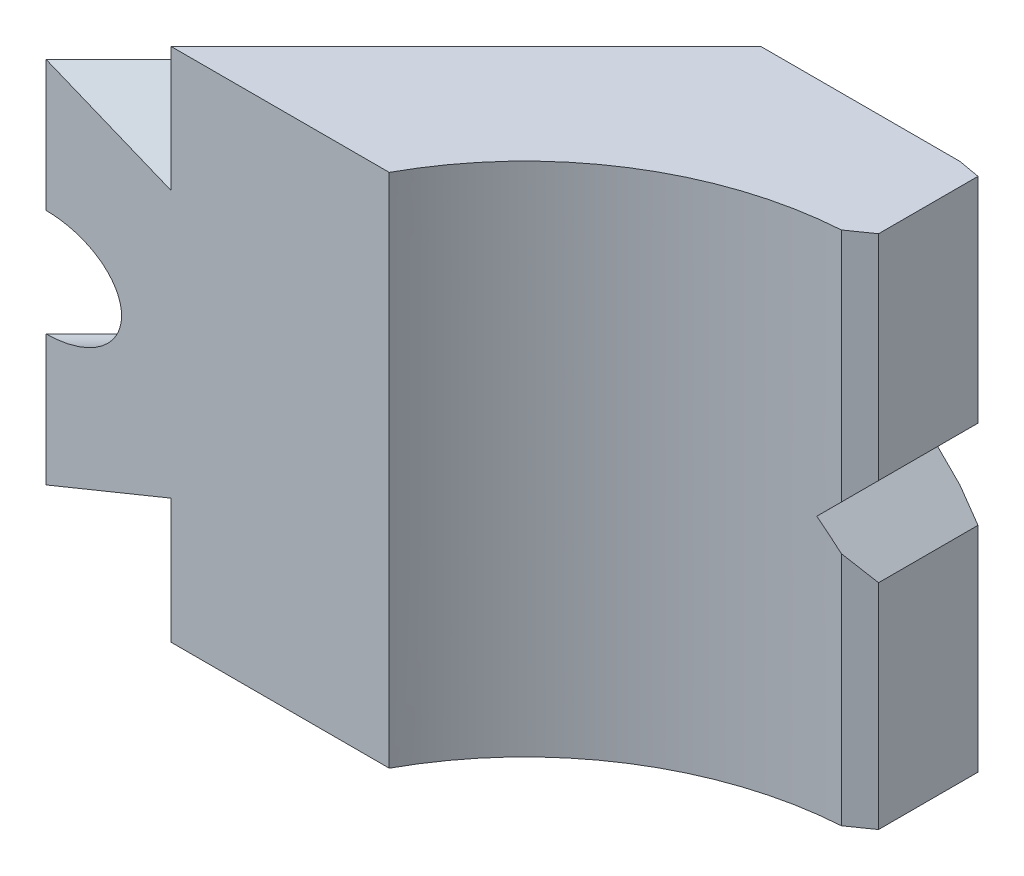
ISO-10303-21;
HEADER;
FILE_DESCRIPTION(('STEP AP214'),'2;1');
FILE_NAME('part.step','',(''),(''),'','','');
FILE_SCHEMA(('AUTOMOTIVE_DESIGN { 1 0 10303 214 1 1 1 1 }'));
ENDSEC;
DATA;
#1=APPLICATION_CONTEXT('core data for automotive mechanical design processes');
#2=APPLICATION_PROTOCOL_DEFINITION('international standard','automotive_design',2000,#1);
#3=PRODUCT_CONTEXT('',#1,'mechanical');
#4=PRODUCT('Part','Part','',(#3));
#5=PRODUCT_RELATED_PRODUCT_CATEGORY('part','',(#4));
#6=PRODUCT_DEFINITION_FORMATION('','',#4);
#7=PRODUCT_DEFINITION_CONTEXT('part definition',#1,'design');
#8=PRODUCT_DEFINITION('design','',#6,#7);
#9=PRODUCT_DEFINITION_SHAPE('','',#8);
#10=(LENGTH_UNIT() NAMED_UNIT(*) SI_UNIT(.MILLI.,.METRE.));
#11=(NAMED_UNIT(*) PLANE_ANGLE_UNIT() SI_UNIT($,.RADIAN.));
#12=(NAMED_UNIT(*) SI_UNIT($,.STERADIAN.) SOLID_ANGLE_UNIT());
#13=UNCERTAINTY_MEASURE_WITH_UNIT(LENGTH_MEASURE(1.E-05),#10,'distance_accuracy_value','');
#14=(GEOMETRIC_REPRESENTATION_CONTEXT(3) GLOBAL_UNCERTAINTY_ASSIGNED_CONTEXT((#13)) GLOBAL_UNIT_ASSIGNED_CONTEXT((#10,
#11,#12)) REPRESENTATION_CONTEXT('',''));
#15=CARTESIAN_POINT('',(0.,0.,0.));
#16=DIRECTION('',(0.,0.,1.));
#17=DIRECTION('',(1.,0.,0.));
#18=AXIS2_PLACEMENT_3D('',#15,#16,#17);
#19=CARTESIAN_POINT('',(-19.0016119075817,-7.084,8.977579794));
#20=DIRECTION('',(-0.707106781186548,0.,0.707106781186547));
#21=DIRECTION('',(0.707106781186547,0.,0.707106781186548));
#22=AXIS2_PLACEMENT_3D('',#19,#20,#21);
#23=PLANE('',#22);
#24=DIRECTION('',(0.,-1.,0.));
#25=VECTOR('',#24,1.);
#26=CARTESIAN_POINT('',(-16.1109196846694,1.73205081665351,11.8682720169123));
#27=LINE('',#26,#25);
#28=CARTESIAN_POINT('',(-16.1109196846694,1.73205081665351,11.8682720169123));
#29=VERTEX_POINT('',#28);
#30=CARTESIAN_POINT('',(-16.1109196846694,-1.7320508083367,11.8682720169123));
#31=VERTEX_POINT('',#30);
#32=EDGE_CURVE('E119',#29,#31,#27,.T.);
#33=ORIENTED_EDGE('',*,*,#32,.F.);
#34=DIRECTION('',(-0.612372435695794,-0.5,-0.612372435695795));
#35=VECTOR('',#34,1.);
#36=CARTESIAN_POINT('',(-13.98959934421,3.46410162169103,13.9895923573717));
#37=LINE('',#36,#35);
#38=CARTESIAN_POINT('',(-13.98959934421,3.46410162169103,13.9895923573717));
#39=VERTEX_POINT('',#38);
#40=EDGE_CURVE('E488',#39,#29,#37,.T.);
#41=ORIENTED_EDGE('',*,*,#40,.F.);
#42=DIRECTION('',(-0.612372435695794,0.5,-0.612372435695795));
#43=VECTOR('',#42,1.);
#44=CARTESIAN_POINT('',(-11.8682789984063,1.73205081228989,16.1109127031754));
#45=LINE('',#44,#43);
#46=CARTESIAN_POINT('',(-11.8682789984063,1.73205081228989,16.1109127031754));
#47=VERTEX_POINT('',#46);
#48=EDGE_CURVE('E491',#47,#39,#45,.T.);
#49=ORIENTED_EDGE('',*,*,#48,.F.);
#50=DIRECTION('',(0.,1.,0.));
#51=VECTOR('',#50,1.);
#52=CARTESIAN_POINT('',(-11.8682789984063,-1.73205080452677,16.1109127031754));
#53=LINE('',#52,#51);
#54=CARTESIAN_POINT('',(-11.8682789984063,-1.73205080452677,16.1109127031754));
#55=VERTEX_POINT('',#54);
#56=EDGE_CURVE('E494',#55,#47,#53,.T.);
#57=ORIENTED_EDGE('',*,*,#56,.F.);
#58=DIRECTION('',(0.612372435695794,0.5,0.612372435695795));
#59=VECTOR('',#58,1.);
#60=CARTESIAN_POINT('',(-13.9895993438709,-3.46410161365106,13.9895923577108));
#61=LINE('',#60,#59);
#62=CARTESIAN_POINT('',(-13.9895993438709,-3.46410161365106,13.9895923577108));
#63=VERTEX_POINT('',#62);
#64=EDGE_CURVE('E497',#63,#55,#61,.T.);
#65=ORIENTED_EDGE('',*,*,#64,.F.);
#66=DIRECTION('',(0.612372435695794,-0.5,0.612372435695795));
#67=VECTOR('',#66,1.);
#68=CARTESIAN_POINT('',(-16.1109196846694,-1.7320508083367,11.8682720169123));
#69=LINE('',#68,#67);
#70=EDGE_CURVE('E500',#31,#63,#69,.T.);
#71=ORIENTED_EDGE('',*,*,#70,.F.);
#72=EDGE_LOOP('',(#33,#41,#49,#57,#65,#71));
#73=FACE_BOUND('',#72,.T.);
#74=CARTESIAN_POINT('',(-13.9895993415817,0.,13.98959236));
#75=DIRECTION('',(0.707106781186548,0.,-0.707106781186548));
#76=DIRECTION('',(-1.45034367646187E-10,1.,-1.45025753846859E-10));
#77=AXIS2_PLACEMENT_3D('',#74,#75,#76);
#78=CIRCLE('',#77,3.62500000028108);
#79=CARTESIAN_POINT('',(-11.4263372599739,2.82980586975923E-10,16.5528544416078));
#80=VERTEX_POINT('',#79);
#81=CARTESIAN_POINT('',(-13.9895937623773,3.62500000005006,13.9895979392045));
#82=VERTEX_POINT('',#81);
#83=EDGE_CURVE('E402',#80,#82,#78,.F.);
#84=ORIENTED_EDGE('',*,*,#83,.T.);
#85=DIRECTION('',(-2.45659811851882E-09,1.,-3.08384225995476E-09));
#86=VECTOR('',#85,1.);
#87=CARTESIAN_POINT('',(-13.9895937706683,6.99999986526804,13.9895979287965));
#88=LINE('',#87,#86);
#89=CARTESIAN_POINT('',(-13.9895937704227,6.90000000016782,13.9895979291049));
#90=VERTEX_POINT('',#89);
#91=EDGE_CURVE('E297',#82,#90,#88,.T.);
#92=ORIENTED_EDGE('',*,*,#91,.T.);
#93=CARTESIAN_POINT('',(-13.989593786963,-6.90000000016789,13.9895979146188));
#94=CARTESIAN_POINT('',(-14.3102671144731,-6.89996436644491,13.6689245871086));
#95=CARTESIAN_POINT('',(-14.6274629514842,-6.85578131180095,13.3517287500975));
#96=CARTESIAN_POINT('',(-15.2554305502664,-6.67905861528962,12.7237611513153));
#97=CARTESIAN_POINT('',(-15.5609594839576,-6.54806321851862,12.4182322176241));
#98=CARTESIAN_POINT('',(-16.1524820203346,-6.2014803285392,11.8267096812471));
#99=CARTESIAN_POINT('',(-16.4340695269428,-5.9887067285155,11.5451221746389));
#100=CARTESIAN_POINT('',(-16.9664151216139,-5.48558263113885,11.0127765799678));
#101=CARTESIAN_POINT('',(-17.2132399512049,-5.19920759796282,10.7659517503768));
#102=CARTESIAN_POINT('',(-17.6659508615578,-4.55887707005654,10.3132408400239));
#103=CARTESIAN_POINT('',(-17.868527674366,-4.20990583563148,10.1106640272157));
#104=CARTESIAN_POINT('',(-18.2242064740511,-3.45697642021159,9.75498522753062));
#105=CARTESIAN_POINT('',(-18.3747503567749,-3.05881975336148,9.60444134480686));
#106=CARTESIAN_POINT('',(-18.619728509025,-2.2222261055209,9.35946319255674));
#107=CARTESIAN_POINT('',(-18.7124541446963,-1.7901849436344,9.26673755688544));
#108=CARTESIAN_POINT('',(-18.8373172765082,-0.90207688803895,9.14187442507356));
#109=CARTESIAN_POINT('',(-18.8686612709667,-0.452754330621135,9.11053043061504));
#110=CARTESIAN_POINT('',(-18.868610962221,0.452738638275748,9.11058073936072));
#111=CARTESIAN_POINT('',(-18.8373687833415,0.902075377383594,9.1418229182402));
#112=CARTESIAN_POINT('',(-18.7124069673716,1.79015567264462,9.26678473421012));
#113=CARTESIAN_POINT('',(-18.6197792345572,2.22223883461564,9.35941246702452));
#114=CARTESIAN_POINT('',(-18.3747081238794,3.05877802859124,9.60448357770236));
#115=CARTESIAN_POINT('',(-18.2242544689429,3.45700289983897,9.75493723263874));
#116=CARTESIAN_POINT('',(-17.8684920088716,4.20985326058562,10.1106996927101));
#117=CARTESIAN_POINT('',(-17.6659942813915,4.55891628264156,10.3131974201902));
#118=CARTESIAN_POINT('',(-17.2132122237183,5.19914619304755,10.7659794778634));
#119=CARTESIAN_POINT('',(-16.9664522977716,5.4856330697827,11.0127394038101));
#120=CARTESIAN_POINT('',(-16.4340508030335,5.98863885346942,11.5451408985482));
#121=CARTESIAN_POINT('',(-16.152511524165,6.20154005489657,11.8266801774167));
#122=CARTESIAN_POINT('',(-15.5609504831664,6.54799148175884,12.4182412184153));
#123=CARTESIAN_POINT('',(-15.2554512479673,6.67912533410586,12.7237404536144));
#124=CARTESIAN_POINT('',(-14.6274640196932,6.85570847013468,13.3517276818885));
#125=CARTESIAN_POINT('',(-14.3100016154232,6.89996439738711,13.6691900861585));
#126=CARTESIAN_POINT('',(-13.9895937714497,6.90000000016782,13.989597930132));
#127=B_SPLINE_CURVE_WITH_KNOTS('',3,(#93,#94,#95,#96,#97,#98,#99,#100,#101,#102,#103,#104,#105,
#106,#107,#108,#109,#110,#111,#112,#113,#114,#115,#116,#117,#118,#119,#120,#121,#122,#123,#124,
#125,#126),.UNSPECIFIED.,.F.,.F.,(4,2,2,2,2,2,2,2,2,2,2,2,2,2,2,2,4),(0.,0.0625,0.125,0.1875,
0.25,0.3125,0.375,0.4375,0.5,0.5625,0.625,0.6875,0.75,0.8125,0.875,0.9375,1.),.UNSPECIFIED.);
#128=CARTESIAN_POINT('',(-13.9895937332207,-6.90000000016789,13.989597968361));
#129=VERTEX_POINT('',#128);
#130=EDGE_CURVE('E18',#90,#129,#127,.F.);
#131=ORIENTED_EDGE('',*,*,#130,.T.);
#132=DIRECTION('',(-2.77021303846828E-09,1.,-2.77022734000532E-09));
#133=VECTOR('',#132,1.);
#134=CARTESIAN_POINT('',(-13.9895937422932,-3.6250001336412,13.9895979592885));
#135=LINE('',#134,#133);
#136=CARTESIAN_POINT('',(-13.9895937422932,-3.62499999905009,13.9895979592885));
#137=VERTEX_POINT('',#136);
#138=EDGE_CURVE('E305',#129,#137,#135,.T.);
#139=ORIENTED_EDGE('',*,*,#138,.T.);
#140=CARTESIAN_POINT('',(-13.9895993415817,0.,13.98959236));
#141=DIRECTION('',(0.707106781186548,0.,-0.707106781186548));
#142=DIRECTION('',(0.707106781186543,-1.79586368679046E-10,0.707106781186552));
#143=AXIS2_PLACEMENT_3D('',#140,#141,#142);
#144=CIRCLE('',#143,3.62500000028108);
#145=EDGE_CURVE('E397',#137,#80,#144,.F.);
#146=ORIENTED_EDGE('',*,*,#145,.T.);
#147=EDGE_LOOP('',(#84,#92,#131,#139,#146));
#148=FACE_BOUND('',#147,.T.);
#149=ADVANCED_FACE('F14',(#73,#148),#23,.T.);
#150=CARTESIAN_POINT('',(-81.5147255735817,-17.5,20.));
#151=DIRECTION('',(0.,0.,1.));
#152=DIRECTION('',(1.,0.,0.));
#153=AXIS2_PLACEMENT_3D('',#150,#151,#152);
#154=PLANE('',#153);
#155=DIRECTION('',(0.925820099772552,0.377964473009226,0.));
#156=VECTOR('',#155,1.);
#157=CARTESIAN_POINT('',(-74.476542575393,-34.7399570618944,20.));
#158=LINE('',#157,#156);
#159=CARTESIAN_POINT('',(-19.9999958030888,-12.5,20.0000000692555));
#160=VERTEX_POINT('',#159);
#161=CARTESIAN_POINT('',(-11.5147144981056,-9.03589838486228,20.));
#162=VERTEX_POINT('',#161);
#163=EDGE_CURVE('E513',#160,#162,#158,.T.);
#164=ORIENTED_EDGE('',*,*,#163,.T.);
#165=DIRECTION('',(0.,-1.,0.));
#166=VECTOR('',#165,1.);
#167=CARTESIAN_POINT('',(-11.5147144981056,-17.5,20.));
#168=LINE('',#167,#166);
#169=CARTESIAN_POINT('',(-11.5147144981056,-17.5,20.));
#170=VERTEX_POINT('',#169);
#171=EDGE_CURVE('E504',#162,#170,#168,.T.);
#172=ORIENTED_EDGE('',*,*,#171,.T.);
#173=CARTESIAN_POINT('',(3.28098316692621,-17.5,20.));
#174=DIRECTION('',(-1.,0.,0.));
#175=VECTOR('',#174,1.);
#176=LINE('',#173,#175);
#177=CARTESIAN_POINT('',(3.28098314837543,-17.5,20.0000000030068));
#178=VERTEX_POINT('',#177);
#179=EDGE_CURVE('E252',#178,#170,#176,.T.);
#180=ORIENTED_EDGE('',*,*,#179,.F.);
#181=CARTESIAN_POINT('',(3.28098313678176,17.5,20.0000000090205));
#182=CARTESIAN_POINT('',(3.28098313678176,16.0416666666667,20.0000000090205));
#183=CARTESIAN_POINT('',(3.28098313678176,14.5833333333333,20.0000000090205));
#184=CARTESIAN_POINT('',(3.28098313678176,11.6666666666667,20.0000000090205));
#185=CARTESIAN_POINT('',(3.28098313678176,10.2083333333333,20.0000000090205));
#186=CARTESIAN_POINT('',(3.28098313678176,7.29166666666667,20.0000000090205));
#187=CARTESIAN_POINT('',(3.28098313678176,5.83333333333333,20.0000000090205));
#188=CARTESIAN_POINT('',(3.28098313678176,2.91666666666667,20.0000000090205));
#189=CARTESIAN_POINT('',(3.28098313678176,1.45833333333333,20.0000000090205));
#190=CARTESIAN_POINT('',(3.28098313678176,-1.45833333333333,20.0000000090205));
#191=CARTESIAN_POINT('',(3.28098313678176,-2.91666666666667,20.0000000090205));
#192=CARTESIAN_POINT('',(3.28098313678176,-5.83333333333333,20.0000000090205));
#193=CARTESIAN_POINT('',(3.28098313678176,-7.29166666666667,20.0000000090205));
#194=CARTESIAN_POINT('',(3.28098313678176,-10.2083333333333,20.0000000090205));
#195=CARTESIAN_POINT('',(3.28098313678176,-11.6666666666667,20.0000000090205));
#196=CARTESIAN_POINT('',(3.28098313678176,-14.5833333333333,20.0000000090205));
#197=CARTESIAN_POINT('',(3.28098313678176,-16.0416666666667,20.0000000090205));
#198=CARTESIAN_POINT('',(3.28098313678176,-17.5,20.0000000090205));
#199=B_SPLINE_CURVE_WITH_KNOTS('',3,(#181,#182,#183,#184,#185,#186,#187,#188,#189,#190,#191,
#192,#193,#194,#195,#196,#197,#198),.UNSPECIFIED.,.F.,.F.,(4,2,2,2,2,2,2,2,4),(0.,4.375,8.75,
13.125,17.5,21.875,26.25,30.625,35.),.UNSPECIFIED.);
#200=CARTESIAN_POINT('',(3.28098314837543,17.5,20.0000000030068));
#201=VERTEX_POINT('',#200);
#202=EDGE_CURVE('E799',#178,#201,#199,.F.);
#203=ORIENTED_EDGE('',*,*,#202,.T.);
#204=CARTESIAN_POINT('',(3.28098316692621,17.5,20.));
#205=DIRECTION('',(-1.,0.,0.));
#206=VECTOR('',#205,1.);
#207=LINE('',#204,#206);
#208=CARTESIAN_POINT('',(-11.5147144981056,17.5,20.));
#209=VERTEX_POINT('',#208);
#210=EDGE_CURVE('E269',#201,#209,#207,.T.);
#211=ORIENTED_EDGE('',*,*,#210,.T.);
#212=DIRECTION('',(0.,-1.,0.));
#213=VECTOR('',#212,1.);
#214=CARTESIAN_POINT('',(-11.5147144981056,-17.5,20.));
#215=LINE('',#214,#213);
#216=CARTESIAN_POINT('',(-11.5147144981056,9.03589838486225,20.));
#217=VERTEX_POINT('',#216);
#218=EDGE_CURVE('E519',#209,#217,#215,.T.);
#219=ORIENTED_EDGE('',*,*,#218,.T.);
#220=DIRECTION('',(-0.925820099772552,0.377964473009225,0.));
#221=VECTOR('',#220,1.);
#222=CARTESIAN_POINT('',(-62.2290938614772,29.7399570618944,20.));
#223=LINE('',#222,#221);
#224=CARTESIAN_POINT('',(-19.9999958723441,12.5,20.));
#225=VERTEX_POINT('',#224);
#226=EDGE_CURVE('E516',#217,#225,#223,.T.);
#227=ORIENTED_EDGE('',*,*,#226,.T.);
#228=DIRECTION('',(5.54044037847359E-09,-1.,0.));
#229=VECTOR('',#228,1.);
#230=CARTESIAN_POINT('',(-19.9999957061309,-17.4999996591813,20.));
#231=LINE('',#230,#229);
#232=CARTESIAN_POINT('',(-19.9999986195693,6.99999999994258,20.0000027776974));
#233=VERTEX_POINT('',#232);
#234=EDGE_CURVE('E556',#225,#233,#231,.T.);
#235=ORIENTED_EDGE('',*,*,#234,.T.);
#236=CARTESIAN_POINT('',(-20.0000069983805,6.999999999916,20.));
#237=DIRECTION('',(0.,-1.,0.));
#238=VECTOR('',#237,1.);
#239=LINE('',#236,#238);
#240=CARTESIAN_POINT('',(-20.0000069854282,3.62500000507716,19.9999999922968));
#241=VERTEX_POINT('',#240);
#242=EDGE_CURVE('E319',#233,#241,#239,.T.);
#243=ORIENTED_EDGE('',*,*,#242,.T.);
#244=CARTESIAN_POINT('',(-14.8734828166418,0.,19.9999999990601));
#245=CARTESIAN_POINT('',(-14.8734797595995,0.0469065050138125,20.0000003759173));
#246=CARTESIAN_POINT('',(-14.8747789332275,0.0938116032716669,20.0000087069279));
#247=CARTESIAN_POINT('',(-14.8799598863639,0.187675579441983,20.0000336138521));
#248=CARTESIAN_POINT('',(-14.883852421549,0.234633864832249,20.00005022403));
#249=CARTESIAN_POINT('',(-14.8942270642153,0.328532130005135,20.000083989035));
#250=CARTESIAN_POINT('',(-14.9007237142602,0.375470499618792,20.0001011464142));
#251=CARTESIAN_POINT('',(-14.916307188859,0.469257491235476,20.0001308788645));
#252=CARTESIAN_POINT('',(-14.925412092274,0.516103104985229,20.0001434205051));
#253=CARTESIAN_POINT('',(-14.9462121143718,0.609632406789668,20.0001606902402));
#254=CARTESIAN_POINT('',(-14.9579285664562,0.65631134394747,20.0001653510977));
#255=CARTESIAN_POINT('',(-14.9839496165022,0.749434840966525,20.0001657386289));
#256=CARTESIAN_POINT('',(-14.9982784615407,0.795872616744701,20.0001613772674));
#257=CARTESIAN_POINT('',(-15.0295205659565,0.888440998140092,20.0001447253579));
#258=CARTESIAN_POINT('',(-15.0464606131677,0.93456255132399,20.0001323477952));
#259=CARTESIAN_POINT('',(-15.0829195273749,1.02642553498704,20.000102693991));
#260=CARTESIAN_POINT('',(-15.1024673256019,1.07215546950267,20.0000853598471));
#261=CARTESIAN_POINT('',(-15.1441346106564,1.16316181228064,20.0000514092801));
#262=CARTESIAN_POINT('',(-15.1662847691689,1.2084241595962,20.0000348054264));
#263=CARTESIAN_POINT('',(-15.2131468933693,1.29842286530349,20.0000084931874));
#264=CARTESIAN_POINT('',(-15.2378908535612,1.34314254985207,19.999998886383));
#265=CARTESIAN_POINT('',(-15.2885331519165,1.42959084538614,20.0000010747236));
#266=CARTESIAN_POINT('',(-15.3143486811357,1.4713680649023,20.0000120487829));
#267=CARTESIAN_POINT('',(-15.3684262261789,1.55460151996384,20.0000456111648));
#268=CARTESIAN_POINT('',(-15.3967291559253,1.59603114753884,20.0000684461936));
#269=CARTESIAN_POINT('',(-15.4557906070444,1.67849149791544,20.0001149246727));
#270=CARTESIAN_POINT('',(-15.4865895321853,1.71949324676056,20.0001385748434));
#271=CARTESIAN_POINT('',(-15.5506511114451,1.80101714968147,20.0001799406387));
#272=CARTESIAN_POINT('',(-15.5839534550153,1.84150808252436,20.0001975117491));
#273=CARTESIAN_POINT('',(-15.6530272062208,1.92192747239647,20.000222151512));
#274=CARTESIAN_POINT('',(-15.6888373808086,1.96182259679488,20.0002289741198));
#275=CARTESIAN_POINT('',(-15.7629296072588,2.04096532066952,20.0002303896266));
#276=CARTESIAN_POINT('',(-15.801249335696,2.08017761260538,20.0002247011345));
#277=CARTESIAN_POINT('',(-15.8803606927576,2.15786757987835,20.0002023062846));
#278=CARTESIAN_POINT('',(-15.9211887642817,2.19630810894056,20.0001853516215));
#279=CARTESIAN_POINT('',(-16.0053138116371,2.27236582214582,20.0001442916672));
#280=CARTESIAN_POINT('',(-16.0486458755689,2.30994416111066,20.0001200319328));
#281=CARTESIAN_POINT('',(-16.1377731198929,2.38418637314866,20.0000727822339));
#282=CARTESIAN_POINT('',(-16.1836019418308,2.42080981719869,20.0000498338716));
#283=CARTESIAN_POINT('',(-16.2777124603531,2.49305258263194,20.0000114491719));
#284=CARTESIAN_POINT('',(-16.3260262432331,2.52863008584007,19.9999961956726));
#285=CARTESIAN_POINT('',(-16.418534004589,2.59403801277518,20.0000033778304));
#286=CARTESIAN_POINT('',(-16.4625877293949,2.6240672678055,20.0000218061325));
#287=CARTESIAN_POINT('',(-16.5531718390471,2.68365185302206,20.0000805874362));
#288=CARTESIAN_POINT('',(-16.5997355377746,2.71315651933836,20.0001216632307));
#289=CARTESIAN_POINT('',(-16.6953569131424,2.77157897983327,20.0002053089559));
#290=CARTESIAN_POINT('',(-16.7444461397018,2.80044508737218,20.0002478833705));
#291=CARTESIAN_POINT('',(-16.845133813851,2.85747060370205,20.000323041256));
#292=CARTESIAN_POINT('',(-16.8967621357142,2.88557722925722,20.0003552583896));
#293=CARTESIAN_POINT('',(-17.0025381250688,2.94095976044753,20.0004011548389));
#294=CARTESIAN_POINT('',(-17.0567139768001,2.96818179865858,20.0004142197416));
#295=CARTESIAN_POINT('',(-17.1675903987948,3.02166644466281,20.0004184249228));
#296=CARTESIAN_POINT('',(-17.2243174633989,3.04787409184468,20.0004088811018));
#297=CARTESIAN_POINT('',(-17.3402963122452,3.09919703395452,20.0003694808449));
#298=CARTESIAN_POINT('',(-17.3995728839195,3.12425627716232,20.0003390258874));
#299=CARTESIAN_POINT('',(-17.520645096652,3.17314547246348,20.0002652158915));
#300=CARTESIAN_POINT('',(-17.5824637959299,3.19691828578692,20.0002215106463));
#301=CARTESIAN_POINT('',(-17.7086083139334,3.24309429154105,20.0001338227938));
#302=CARTESIAN_POINT('',(-17.7729554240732,3.26543927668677,20.0000898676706));
#303=CARTESIAN_POINT('',(-17.9041390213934,3.30861537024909,20.0000236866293));
#304=CARTESIAN_POINT('',(-17.9709950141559,3.32938720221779,20.0000020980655));
#305=CARTESIAN_POINT('',(-18.095010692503,3.36571180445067,19.9999982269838));
#306=CARTESIAN_POINT('',(-18.1520794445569,3.38157583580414,20.0000104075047));
#307=CARTESIAN_POINT('',(-18.2697139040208,3.41257734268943,20.0000333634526));
#308=CARTESIAN_POINT('',(-18.3303020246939,3.42762931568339,20.000044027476));
#309=CARTESIAN_POINT('',(-18.5220126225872,3.47243498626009,20.0000627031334));
#310=CARTESIAN_POINT('',(-18.6538706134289,3.49911675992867,20.0000534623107));
#311=CARTESIAN_POINT('',(-18.857362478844,3.53418553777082,20.0000073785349));
#312=CARTESIAN_POINT('',(-18.9285399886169,3.54531560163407,19.999985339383));
#313=CARTESIAN_POINT('',(-19.0482664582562,3.56215215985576,20.0000099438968));
#314=CARTESIAN_POINT('',(-19.0967321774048,3.5684518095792,20.0000367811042));
#315=CARTESIAN_POINT('',(-19.269140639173,3.58905865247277,20.0001193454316));
#316=CARTESIAN_POINT('',(-19.39342175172,3.60060995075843,20.0001552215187));
#317=CARTESIAN_POINT('',(-19.678378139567,3.6196432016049,20.0001647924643));
#318=CARTESIAN_POINT('',(-19.8391996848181,3.62498689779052,20.0001175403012));
#319=CARTESIAN_POINT('',(-20.0000069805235,3.62500000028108,19.9999999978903));
#320=B_SPLINE_CURVE_WITH_KNOTS('',3,(#244,#245,#246,#247,#248,#249,#250,#251,#252,#253,#254,
#255,#256,#257,#258,#259,#260,#261,#262,#263,#264,#265,#266,#267,#268,#269,#270,#271,#272,#273,
#274,#275,#276,#277,#278,#279,#280,#281,#282,#283,#284,#285,#286,#287,#288,#289,#290,#291,#292,
#293,#294,#295,#296,#297,#298,#299,#300,#301,#302,#303,#304,#305,#306,#307,#308,#309,#310,#311,
#312,#313,#314,#315,#316,#317,#318,#319),.UNSPECIFIED.,.F.,.F.,(4,2,2,2,2,2,2,2,2,2,2,2,2,2,2,2,
2,2,2,2,2,2,2,2,2,2,2,2,2,2,2,2,2,2,2,2,2,4),(0.,0.140699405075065,0.281986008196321,
0.424072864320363,0.567169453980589,0.711480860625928,0.857207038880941,1.00454218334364,
1.15367420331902,1.30478430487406,1.45804667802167,1.60532423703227,1.75579565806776,
1.90958733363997,2.06681764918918,2.22759739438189,2.39203018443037,2.56021288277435,
2.73223601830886,2.90818419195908,3.08813646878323,3.2480521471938,3.41339456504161,
3.58420562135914,3.76052331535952,3.94238219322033,4.12981373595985,4.32284669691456,
4.52150739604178,4.72581997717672,4.9358066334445,5.11348219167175,5.30075288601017,
5.70406628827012,5.92016534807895,6.06677686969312,6.44105145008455,6.92340218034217),.UNSPECIFIED.);
#321=CARTESIAN_POINT('',(-14.8734828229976,-2.17019483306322E-10,19.9999999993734));
#322=VERTEX_POINT('',#321);
#323=EDGE_CURVE('E843',#241,#322,#320,.F.);
#324=ORIENTED_EDGE('',*,*,#323,.T.);
#325=CARTESIAN_POINT('',(-20.0000069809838,-3.62500000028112,19.99999999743));
#326=CARTESIAN_POINT('',(-19.8391996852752,-3.6249868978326,20.0001175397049));
#327=CARTESIAN_POINT('',(-19.6783781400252,-3.61964320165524,20.0001647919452));
#328=CARTESIAN_POINT('',(-19.3934217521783,-3.60060995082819,20.0001552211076));
#329=CARTESIAN_POINT('',(-19.2691406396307,-3.58905865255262,20.0001193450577));
#330=CARTESIAN_POINT('',(-19.0967321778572,-3.56845180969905,20.000036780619));
#331=CARTESIAN_POINT('',(-19.0482664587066,-3.56215215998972,20.0000099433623));
#332=CARTESIAN_POINT('',(-18.9285399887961,-3.54531560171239,19.9999853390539));
#333=CARTESIAN_POINT('',(-18.8573624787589,-3.53418553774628,20.000007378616));
#334=CARTESIAN_POINT('',(-18.6538706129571,-3.49911675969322,20.0000534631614));
#335=CARTESIAN_POINT('',(-18.5220126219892,-3.47243498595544,20.0000627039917));
#336=CARTESIAN_POINT('',(-18.3303020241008,-3.42762931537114,20.0000440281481));
#337=CARTESIAN_POINT('',(-18.269713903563,-3.41257734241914,20.0000333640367));
#338=CARTESIAN_POINT('',(-18.1520794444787,-3.3815758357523,20.0000104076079));
#339=CARTESIAN_POINT('',(-18.0950106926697,-3.36571180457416,19.9999982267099));
#340=CARTESIAN_POINT('',(-17.9709950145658,-3.32938720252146,20.0000020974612));
#341=CARTESIAN_POINT('',(-17.9041390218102,-3.30861537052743,20.0000236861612));
#342=CARTESIAN_POINT('',(-17.7729554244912,-3.2654392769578,20.0000898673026));
#343=CARTESIAN_POINT('',(-17.7086083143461,-3.24309429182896,20.0001338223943));
#344=CARTESIAN_POINT('',(-17.582463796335,-3.19691828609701,20.0002215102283));
#345=CARTESIAN_POINT('',(-17.5206450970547,-3.1731454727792,20.0002652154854));
#346=CARTESIAN_POINT('',(-17.3995728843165,-3.12425627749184,20.0003390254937));
#347=CARTESIAN_POINT('',(-17.3402963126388,-3.09919703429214,20.0003694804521));
#348=CARTESIAN_POINT('',(-17.2243174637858,-3.04787409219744,20.000408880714));
#349=CARTESIAN_POINT('',(-17.1675903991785,-3.02166644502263,20.0004184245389));
#350=CARTESIAN_POINT('',(-17.056713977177,-2.96818179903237,20.0004142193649));
#351=CARTESIAN_POINT('',(-17.0025381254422,-2.94095976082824,20.0004011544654));
#352=CARTESIAN_POINT('',(-16.8967621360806,-2.88557722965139,20.0003552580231));
#353=CARTESIAN_POINT('',(-16.8451338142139,-2.85747060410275,20.0003230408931));
#354=CARTESIAN_POINT('',(-16.7444461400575,-2.80044508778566,20.0002478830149));
#355=CARTESIAN_POINT('',(-16.6953569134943,-2.77157898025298,20.000205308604));
#356=CARTESIAN_POINT('',(-16.5997355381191,-2.7131565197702,20.0001216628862));
#357=CARTESIAN_POINT('',(-16.5531718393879,-2.68365185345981,20.0000805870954));
#358=CARTESIAN_POINT('',(-16.4625877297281,-2.62406726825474,20.0000218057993));
#359=CARTESIAN_POINT('',(-16.4185340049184,-2.59403801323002,20.000003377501));
#360=CARTESIAN_POINT('',(-16.3260262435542,-2.52863008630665,19.9999961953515));
#361=CARTESIAN_POINT('',(-16.2777124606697,-2.49305258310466,20.0000114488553));
#362=CARTESIAN_POINT('',(-16.1836019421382,-2.42080981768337,20.0000498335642));
#363=CARTESIAN_POINT('',(-16.1377731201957,-2.38418637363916,20.0000727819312));
#364=CARTESIAN_POINT('',(-16.0486458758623,-2.30994416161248,20.0001200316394));
#365=CARTESIAN_POINT('',(-16.0053138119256,-2.27236582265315,20.0001442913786));
#366=CARTESIAN_POINT('',(-15.9211887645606,-2.19630810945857,20.0001853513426));
#367=CARTESIAN_POINT('',(-15.8803606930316,-2.15786758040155,20.0002023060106));
#368=CARTESIAN_POINT('',(-15.8012493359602,-2.08017761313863,20.0002247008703));
#369=CARTESIAN_POINT('',(-15.762929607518,-2.04096532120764,20.0002303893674));
#370=CARTESIAN_POINT('',(-15.6888373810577,-1.9618225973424,20.0002289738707));
#371=CARTESIAN_POINT('',(-15.6530272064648,-1.92192747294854,20.0002221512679));
#372=CARTESIAN_POINT('',(-15.5839534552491,-1.84150808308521,20.0001975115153));
#373=CARTESIAN_POINT('',(-15.5506511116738,-1.80101715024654,20.00017994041));
#374=CARTESIAN_POINT('',(-15.4865895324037,-1.71949324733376,20.000138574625));
#375=CARTESIAN_POINT('',(-15.4557906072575,-1.67849149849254,20.0001149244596));
#376=CARTESIAN_POINT('',(-15.3967291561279,-1.59603114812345,20.0000684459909));
#377=CARTESIAN_POINT('',(-15.3684262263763,-1.55460152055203,20.0000456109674));
#378=CARTESIAN_POINT('',(-15.3143486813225,-1.47136806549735,20.000012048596));
#379=CARTESIAN_POINT('',(-15.2885331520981,-1.42959084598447,20.000001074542));
#380=CARTESIAN_POINT('',(-15.2378908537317,-1.34314255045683,19.9999988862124));
#381=CARTESIAN_POINT('',(-15.2131468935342,-1.29842286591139,20.0000084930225));
#382=CARTESIAN_POINT('',(-15.1662847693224,-1.20842416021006,20.000034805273));
#383=CARTESIAN_POINT('',(-15.1441346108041,-1.16316181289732,20.0000514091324));
#384=CARTESIAN_POINT('',(-15.1024673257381,-1.07215547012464,20.000085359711));
#385=CARTESIAN_POINT('',(-15.0829195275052,-1.02642553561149,20.0001026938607));
#386=CARTESIAN_POINT('',(-15.0464606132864,-0.934562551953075,20.0001323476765));
#387=CARTESIAN_POINT('',(-15.0295205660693,-0.888440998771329,20.0001447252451));
#388=CARTESIAN_POINT('',(-14.9982784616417,-0.795872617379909,20.0001613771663));
#389=CARTESIAN_POINT('',(-14.9839496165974,-0.749434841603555,20.0001657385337));
#390=CARTESIAN_POINT('',(-14.9579285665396,-0.656311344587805,20.0001653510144));
#391=CARTESIAN_POINT('',(-14.9462121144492,-0.60963240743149,20.0001606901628));
#392=CARTESIAN_POINT('',(-14.9254120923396,-0.516103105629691,20.0001434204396));
#393=CARTESIAN_POINT('',(-14.9163071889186,-0.469257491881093,20.0001308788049));
#394=CARTESIAN_POINT('',(-14.9007237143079,-0.375470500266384,20.0001011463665));
#395=CARTESIAN_POINT('',(-14.894227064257,-0.32853213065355,20.0000839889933));
#396=CARTESIAN_POINT('',(-14.8838524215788,-0.234633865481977,20.0000502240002));
#397=CARTESIAN_POINT('',(-14.8799598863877,-0.187675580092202,20.0000336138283));
#398=CARTESIAN_POINT('',(-14.8747789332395,-0.093811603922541,20.000008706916));
#399=CARTESIAN_POINT('',(-14.8734797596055,-0.0469065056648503,20.0000003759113));
#400=CARTESIAN_POINT('',(-14.8734828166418,-6.51018801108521E-10,19.9999999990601));
#401=B_SPLINE_CURVE_WITH_KNOTS('',3,(#325,#326,#327,#328,#329,#330,#331,#332,#333,#334,#335,
#336,#337,#338,#339,#340,#341,#342,#343,#344,#345,#346,#347,#348,#349,#350,#351,#352,#353,#354,
#355,#356,#357,#358,#359,#360,#361,#362,#363,#364,#365,#366,#367,#368,#369,#370,#371,#372,#373,
#374,#375,#376,#377,#378,#379,#380,#381,#382,#383,#384,#385,#386,#387,#388,#389,#390,#391,#392,
#393,#394,#395,#396,#397,#398,#399,#400),.UNSPECIFIED.,.F.,.F.,(4,2,2,2,2,2,2,2,2,2,2,2,2,2,2,2,
2,2,2,2,2,2,2,2,2,2,2,2,2,2,2,2,2,2,2,2,2,4),(0.,0.482350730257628,0.856625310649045,
1.00323683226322,1.21933589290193,1.62264929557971,1.80991998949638,1.98759554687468,
2.19758220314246,2.4018947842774,2.60055548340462,2.79358844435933,2.98101998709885,
3.16287886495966,3.33919655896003,3.51000761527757,3.67535003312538,3.83526571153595,
4.0152179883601,4.19116616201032,4.36318929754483,4.53137199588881,4.69580478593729,
4.85658453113,5.01381484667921,5.16760652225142,5.31807794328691,5.46535550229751,
5.61861787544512,5.76972797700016,5.91885999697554,6.06619514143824,6.21192131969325,
6.35623272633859,6.49932931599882,6.64141617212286,6.78270277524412,6.92340218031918),.UNSPECIFIED.);
#402=CARTESIAN_POINT('',(-20.0000013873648,-3.6250000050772,20.0000056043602));
#403=VERTEX_POINT('',#402);
#404=EDGE_CURVE('E451',#322,#403,#401,.F.);
#405=ORIENTED_EDGE('',*,*,#404,.T.);
#406=CARTESIAN_POINT('',(-20.0000069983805,-3.62500001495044,20.));
#407=DIRECTION('',(0.,-1.,0.));
#408=VECTOR('',#407,1.);
#409=LINE('',#406,#408);
#410=CARTESIAN_POINT('',(-19.9999985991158,-6.99999999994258,20.0000028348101));
#411=VERTEX_POINT('',#410);
#412=EDGE_CURVE('E390',#403,#411,#409,.T.);
#413=ORIENTED_EDGE('',*,*,#412,.T.);
#414=DIRECTION('',(0.,-1.,0.));
#415=VECTOR('',#414,1.);
#416=CARTESIAN_POINT('',(-19.9999958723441,-17.5,20.));
#417=LINE('',#416,#415);
#418=EDGE_CURVE('E529',#411,#160,#417,.T.);
#419=ORIENTED_EDGE('',*,*,#418,.T.);
#420=EDGE_LOOP('',(#164,#172,#180,#203,#211,#219,#227,#235,#243,#324,#405,#413,#419));
#421=FACE_BOUND('',#420,.T.);
#422=ADVANCED_FACE('F740',(#421),#154,.T.);
#423=CARTESIAN_POINT('',(-81.5147255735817,17.5,20.));
#424=DIRECTION('',(0.,-1.,0.));
#425=DIRECTION('',(0.,0.,-1.));
#426=AXIS2_PLACEMENT_3D('',#423,#424,#425);
#427=PLANE('',#426);
#428=DIRECTION('',(0.,0.,-1.));
#429=VECTOR('',#428,1.);
#430=CARTESIAN_POINT('',(23.4799930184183,17.5,7.008895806));
#431=LINE('',#430,#429);
#432=CARTESIAN_POINT('',(23.4799930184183,17.5,0.264490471));
#433=VERTEX_POINT('',#432);
#434=CARTESIAN_POINT('',(23.4799930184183,17.5,7.00889580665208));
#435=VERTEX_POINT('',#434);
#436=EDGE_CURVE('E233',#433,#435,#431,.F.);
#437=ORIENTED_EDGE('',*,*,#436,.F.);
#438=DIRECTION('',(-0.984807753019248,0.,-0.173648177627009));
#439=VECTOR('',#438,1.);
#440=CARTESIAN_POINT('',(23.4799930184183,17.5,0.264490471));
#441=LINE('',#440,#439);
#442=CARTESIAN_POINT('',(21.9799930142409,17.5,6.44124944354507E-10));
#443=VERTEX_POINT('',#442);
#444=EDGE_CURVE('E223',#443,#433,#441,.F.);
#445=ORIENTED_EDGE('',*,*,#444,.F.);
#446=DIRECTION('',(1.,0.,0.));
#447=VECTOR('',#446,1.);
#448=CARTESIAN_POINT('',(-81.5147255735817,17.5,0.));
#449=LINE('',#448,#447);
#450=CARTESIAN_POINT('',(18.4799930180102,17.5,0.));
#451=VERTEX_POINT('',#450);
#452=EDGE_CURVE('E132',#443,#451,#449,.F.);
#453=ORIENTED_EDGE('',*,*,#452,.T.);
#454=CARTESIAN_POINT('',(18.4799930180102,17.5,0.));
#455=DIRECTION('',(-1.,0.,0.));
#456=VECTOR('',#455,1.);
#457=LINE('',#454,#456);
#458=CARTESIAN_POINT('',(8.48528550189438,17.5,0.));
#459=VERTEX_POINT('',#458);
#460=EDGE_CURVE('E196',#451,#459,#457,.T.);
#461=ORIENTED_EDGE('',*,*,#460,.T.);
#462=DIRECTION('',(0.707106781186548,0.,-0.707106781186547));
#463=VECTOR('',#462,1.);
#464=CARTESIAN_POINT('',(-46.5147200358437,17.5,55.0000055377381));
#465=LINE('',#464,#463);
#466=EDGE_CURVE('E524',#209,#459,#465,.T.);
#467=ORIENTED_EDGE('',*,*,#466,.F.);
#468=ORIENTED_EDGE('',*,*,#210,.F.);
#469=CARTESIAN_POINT('',(23.4799930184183,17.5,31.));
#470=DIRECTION('',(0.,1.,0.));
#471=DIRECTION('',(-0.064516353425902,0.,-0.997916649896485));
#472=AXIS2_PLACEMENT_3D('',#469,#470,#471);
#473=CIRCLE('',#472,23.);
#474=CARTESIAN_POINT('',(21.9961169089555,17.5,8.04791704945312));
#475=VERTEX_POINT('',#474);
#476=EDGE_CURVE('E243',#475,#201,#473,.T.);
#477=ORIENTED_EDGE('',*,*,#476,.F.);
#478=DIRECTION('',(0.819152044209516,0.,-0.57357643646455));
#479=VECTOR('',#478,1.);
#480=CARTESIAN_POINT('',(21.9961168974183,17.5,8.047917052));
#481=LINE('',#480,#479);
#482=EDGE_CURVE('E238',#435,#475,#481,.F.);
#483=ORIENTED_EDGE('',*,*,#482,.F.);
#484=EDGE_LOOP('',(#437,#445,#453,#461,#467,#468,#477,#483));
#485=FACE_BOUND('',#484,.T.);
#486=ADVANCED_FACE('F1024',(#485),#427,.F.);
#487=CARTESIAN_POINT('',(-81.5147255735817,-17.5,20.));
#488=DIRECTION('',(0.,-1.,0.));
#489=DIRECTION('',(0.,0.,-1.));
#490=AXIS2_PLACEMENT_3D('',#487,#488,#489);
#491=PLANE('',#490);
#492=DIRECTION('',(-0.984807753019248,0.,-0.173648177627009));
#493=VECTOR('',#492,1.);
#494=CARTESIAN_POINT('',(23.4799930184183,-17.5,0.264490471));
#495=LINE('',#494,#493);
#496=CARTESIAN_POINT('',(23.4799930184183,-17.5,0.264490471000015));
#497=VERTEX_POINT('',#496);
#498=CARTESIAN_POINT('',(21.9799930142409,-17.5,6.44124944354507E-10));
#499=VERTEX_POINT('',#498);
#500=EDGE_CURVE('E126',#497,#499,#495,.T.);
#501=ORIENTED_EDGE('',*,*,#500,.F.);
#502=DIRECTION('',(0.,0.,-1.));
#503=VECTOR('',#502,1.);
#504=CARTESIAN_POINT('',(23.4799930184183,-17.5,20.));
#505=LINE('',#504,#503);
#506=CARTESIAN_POINT('',(23.4799930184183,-17.5,7.00889580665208));
#507=VERTEX_POINT('',#506);
#508=EDGE_CURVE('E264',#497,#507,#505,.F.);
#509=ORIENTED_EDGE('',*,*,#508,.T.);
#510=DIRECTION('',(-0.81915204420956,0.,0.573576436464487));
#511=VECTOR('',#510,1.);
#512=CARTESIAN_POINT('',(23.4799930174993,-17.5,7.00889580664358));
#513=LINE('',#512,#511);
#514=CARTESIAN_POINT('',(21.9961169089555,-17.5,8.04791704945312));
#515=VERTEX_POINT('',#514);
#516=EDGE_CURVE('E259',#507,#515,#513,.T.);
#517=ORIENTED_EDGE('',*,*,#516,.T.);
#518=CARTESIAN_POINT('',(23.4799930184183,-17.5,31.));
#519=DIRECTION('',(0.,-1.,0.));
#520=DIRECTION('',(-0.878217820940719,0.,-0.478260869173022));
#521=AXIS2_PLACEMENT_3D('',#518,#519,#520);
#522=CIRCLE('',#521,23.);
#523=EDGE_CURVE('E263',#515,#178,#522,.F.);
#524=ORIENTED_EDGE('',*,*,#523,.T.);
#525=ORIENTED_EDGE('',*,*,#179,.T.);
#526=DIRECTION('',(0.707106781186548,0.,-0.707106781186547));
#527=VECTOR('',#526,1.);
#528=CARTESIAN_POINT('',(-46.5147200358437,-17.5,55.0000055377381));
#529=LINE('',#528,#527);
#530=CARTESIAN_POINT('',(8.48528550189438,-17.5,0.));
#531=VERTEX_POINT('',#530);
#532=EDGE_CURVE('E509',#170,#531,#529,.T.);
#533=ORIENTED_EDGE('',*,*,#532,.T.);
#534=CARTESIAN_POINT('',(8.48528550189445,-17.5,0.));
#535=DIRECTION('',(1.,0.,0.));
#536=VECTOR('',#535,1.);
#537=LINE('',#534,#536);
#538=CARTESIAN_POINT('',(18.4799930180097,-17.5,0.));
#539=VERTEX_POINT('',#538);
#540=EDGE_CURVE('E129',#531,#539,#537,.T.);
#541=ORIENTED_EDGE('',*,*,#540,.T.);
#542=DIRECTION('',(1.,0.,0.));
#543=VECTOR('',#542,1.);
#544=CARTESIAN_POINT('',(-81.5147255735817,-17.5,0.));
#545=LINE('',#544,#543);
#546=EDGE_CURVE('E34',#539,#499,#545,.T.);
#547=ORIENTED_EDGE('',*,*,#546,.T.);
#548=EDGE_LOOP('',(#501,#509,#517,#524,#525,#533,#541,#547));
#549=FACE_BOUND('',#548,.T.);
#550=ADVANCED_FACE('F124',(#549),#491,.T.);
#551=CARTESIAN_POINT('',(-11.5147255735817,-17.5,0.));
#552=DIRECTION('',(0.,0.,1.));
#553=DIRECTION('',(1.,0.,0.));
#554=AXIS2_PLACEMENT_3D('',#551,#552,#553);
#555=PLANE('',#554);
#556=ORIENTED_EDGE('',*,*,#546,.F.);
#557=ORIENTED_EDGE('',*,*,#540,.F.);
#558=DIRECTION('',(0.,-1.,0.));
#559=VECTOR('',#558,1.);
#560=CARTESIAN_POINT('',(8.48528550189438,-17.5,0.));
#561=LINE('',#560,#559);
#562=CARTESIAN_POINT('',(8.48528550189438,-9.03589838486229,0.));
#563=VERTEX_POINT('',#562);
#564=EDGE_CURVE('E9',#563,#531,#561,.T.);
#565=ORIENTED_EDGE('',*,*,#564,.F.);
#566=DIRECTION('',(0.925820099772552,0.377964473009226,0.));
#567=VECTOR('',#566,1.);
#568=CARTESIAN_POINT('',(-11.6193997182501,-17.2436017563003,0.));
#569=LINE('',#568,#567);
#570=CARTESIAN_POINT('',(4.19691129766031E-06,-12.5,6.92554655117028E-08));
#571=VERTEX_POINT('',#570);
#572=EDGE_CURVE('E25',#571,#563,#569,.T.);
#573=ORIENTED_EDGE('',*,*,#572,.F.);
#574=CARTESIAN_POINT('',(4.12765581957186E-06,-12.5,0.));
#575=DIRECTION('',(0.,1.,0.));
#576=VECTOR('',#575,1.);
#577=LINE('',#574,#576);
#578=CARTESIAN_POINT('',(-1.37410908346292E-06,-6.99999999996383,5.60980344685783E-06));
#579=VERTEX_POINT('',#578);
#580=EDGE_CURVE('E293',#571,#579,#577,.T.);
#581=ORIENTED_EDGE('',*,*,#580,.T.);
#582=CARTESIAN_POINT('',(-6.97953832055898E-06,-6.999999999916,0.));
#583=DIRECTION('',(0.,1.,0.));
#584=VECTOR('',#583,1.);
#585=LINE('',#582,#584);
#586=CARTESIAN_POINT('',(1.37410908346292E-06,6.99999999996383,2.78401911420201E-06));
#587=VERTEX_POINT('',#586);
#588=EDGE_CURVE('E146',#579,#587,#585,.T.);
#589=ORIENTED_EDGE('',*,*,#588,.T.);
#590=DIRECTION('',(5.54044037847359E-09,-1.,0.));
#591=VECTOR('',#590,1.);
#592=CARTESIAN_POINT('',(4.29386902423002E-06,-17.4999999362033,0.));
#593=LINE('',#592,#591);
#594=CARTESIAN_POINT('',(4.12765583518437E-06,12.5,0.));
#595=VERTEX_POINT('',#594);
#596=EDGE_CURVE('E554',#595,#587,#593,.T.);
#597=ORIENTED_EDGE('',*,*,#596,.F.);
#598=DIRECTION('',(-0.925820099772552,0.377964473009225,0.));
#599=VECTOR('',#598,1.);
#600=CARTESIAN_POINT('',(0.628048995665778,12.2436017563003,0.));
#601=LINE('',#600,#599);
#602=CARTESIAN_POINT('',(8.48528550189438,9.03589838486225,0.));
#603=VERTEX_POINT('',#602);
#604=EDGE_CURVE('E285',#603,#595,#601,.T.);
#605=ORIENTED_EDGE('',*,*,#604,.F.);
#606=DIRECTION('',(0.,-1.,0.));
#607=VECTOR('',#606,1.);
#608=CARTESIAN_POINT('',(8.48528550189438,-17.5,0.));
#609=LINE('',#608,#607);
#610=EDGE_CURVE('E1072',#459,#603,#609,.T.);
#611=ORIENTED_EDGE('',*,*,#610,.F.);
#612=ORIENTED_EDGE('',*,*,#460,.F.);
#613=ORIENTED_EDGE('',*,*,#452,.F.);
#614=CARTESIAN_POINT('',(21.9799930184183,1.50000000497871,0.));
#615=DIRECTION('',(0.,1.,0.));
#616=VECTOR('',#615,1.);
#617=LINE('',#614,#616);
#618=CARTESIAN_POINT('',(21.9799930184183,1.50000000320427,0.));
#619=VERTEX_POINT('',#618);
#620=EDGE_CURVE('E217',#619,#443,#617,.T.);
#621=ORIENTED_EDGE('',*,*,#620,.F.);
#622=DIRECTION('',(-0.707106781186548,-0.707106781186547,0.));
#623=VECTOR('',#622,1.);
#624=CARTESIAN_POINT('',(23.4799930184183,3.,0.));
#625=LINE('',#624,#623);
#626=CARTESIAN_POINT('',(20.4799930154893,2.92897368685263E-09,0.));
#627=VERTEX_POINT('',#626);
#628=EDGE_CURVE('E214',#627,#619,#625,.F.);
#629=ORIENTED_EDGE('',*,*,#628,.F.);
#630=DIRECTION('',(0.707106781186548,-0.707106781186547,0.));
#631=VECTOR('',#630,1.);
#632=CARTESIAN_POINT('',(20.4799930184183,0.,0.));
#633=LINE('',#632,#631);
#634=CARTESIAN_POINT('',(21.9799930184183,-1.50000000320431,0.));
#635=VERTEX_POINT('',#634);
#636=EDGE_CURVE('E49',#635,#627,#633,.F.);
#637=ORIENTED_EDGE('',*,*,#636,.F.);
#638=CARTESIAN_POINT('',(21.9799930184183,-17.5,0.));
#639=DIRECTION('',(0.,1.,0.));
#640=VECTOR('',#639,1.);
#641=LINE('',#638,#640);
#642=EDGE_CURVE('E136',#499,#635,#641,.T.);
#643=ORIENTED_EDGE('',*,*,#642,.F.);
#644=EDGE_LOOP('',(#556,#557,#565,#573,#581,#589,#597,#605,#611,#612,#613,#621,#629,#637,#643));
#645=FACE_BOUND('',#644,.T.);
#646=ADVANCED_FACE('F143',(#645),#555,.F.);
#647=CARTESIAN_POINT('',(-11.4263372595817,0.,16.552854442));
#648=CARTESIAN_POINT('',(-17.4728073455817,0.,22.599324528));
#649=B_SPLINE_CURVE_WITH_KNOTS('',1,(#647,#648),.UNSPECIFIED.,.F.,.F.,(2,2),(0.,1.),.UNSPECIFIED.);
#650=CARTESIAN_POINT('',(-24.1421426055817,0.,24.142135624));
#651=DIRECTION('',(-0.707106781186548,0.,0.707106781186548));
#652=AXIS1_PLACEMENT('',#650,#651);
#653=SURFACE_OF_REVOLUTION('',#649,#652);
#654=ORIENTED_EDGE('',*,*,#145,.F.);
#655=CARTESIAN_POINT('',(-13.9895993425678,-3.6250000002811,13.9895923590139));
#656=CARTESIAN_POINT('',(-14.2400329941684,-3.6250000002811,14.2400260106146));
#657=CARTESIAN_POINT('',(-14.4904666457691,-3.6250000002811,14.4904596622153));
#658=CARTESIAN_POINT('',(-14.9913339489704,-3.6250000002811,14.9913269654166));
#659=CARTESIAN_POINT('',(-15.2417676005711,-3.6250000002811,15.2417606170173));
#660=CARTESIAN_POINT('',(-15.7426349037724,-3.62500000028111,15.7426279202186));
#661=CARTESIAN_POINT('',(-15.9930685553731,-3.62500000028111,15.9930615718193));
#662=CARTESIAN_POINT('',(-16.4939358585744,-3.62500000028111,16.4939288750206));
#663=CARTESIAN_POINT('',(-16.7443695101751,-3.62500000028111,16.7443625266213));
#664=CARTESIAN_POINT('',(-17.2452368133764,-3.62500000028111,17.2452298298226));
#665=CARTESIAN_POINT('',(-17.4956704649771,-3.62500000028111,17.4956634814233));
#666=CARTESIAN_POINT('',(-17.9965377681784,-3.62500000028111,17.9965307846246));
#667=CARTESIAN_POINT('',(-18.2469714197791,-3.62500000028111,18.2469644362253));
#668=CARTESIAN_POINT('',(-18.7478387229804,-3.62500000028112,18.7478317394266));
#669=CARTESIAN_POINT('',(-18.9982723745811,-3.62500000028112,18.9982653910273));
#670=CARTESIAN_POINT('',(-19.4991396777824,-3.62500000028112,19.4991326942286));
#671=CARTESIAN_POINT('',(-19.7495733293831,-3.62500000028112,19.7495663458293));
#672=CARTESIAN_POINT('',(-20.0000069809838,-3.62500000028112,19.99999999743));
#673=B_SPLINE_CURVE_WITH_KNOTS('',3,(#655,#656,#657,#658,#659,#660,#661,#662,#663,#664,#665,
#666,#667,#668,#669,#670,#671,#672),.UNSPECIFIED.,.F.,.F.,(4,2,2,2,2,2,2,2,4),(0.,
1.06249999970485,2.1249999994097,3.18749999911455,4.2499999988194,5.31249999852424,
6.37499999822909,7.43749999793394,8.49999999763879),.UNSPECIFIED.);
#674=EDGE_CURVE('E374',#137,#403,#673,.T.);
#675=ORIENTED_EDGE('',*,*,#674,.T.);
#676=ORIENTED_EDGE('',*,*,#404,.F.);
#677=ORIENTED_EDGE('',*,*,#323,.F.);
#678=CARTESIAN_POINT('',(-20.0000069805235,3.62500000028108,19.9999999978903));
#679=CARTESIAN_POINT('',(-19.7495733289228,3.62500000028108,19.7495663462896));
#680=CARTESIAN_POINT('',(-19.4991396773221,3.62500000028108,19.499132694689));
#681=CARTESIAN_POINT('',(-18.9982723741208,3.62500000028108,18.9982653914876));
#682=CARTESIAN_POINT('',(-18.7478387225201,3.62500000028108,18.747831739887));
#683=CARTESIAN_POINT('',(-18.2469714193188,3.62500000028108,18.2469644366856));
#684=CARTESIAN_POINT('',(-17.9965377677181,3.62500000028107,17.9965307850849));
#685=CARTESIAN_POINT('',(-17.4956704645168,3.62500000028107,17.4956634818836));
#686=CARTESIAN_POINT('',(-17.2452368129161,3.62500000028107,17.2452298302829));
#687=CARTESIAN_POINT('',(-16.7443695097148,3.62500000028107,16.7443625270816));
#688=CARTESIAN_POINT('',(-16.4939358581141,3.62500000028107,16.4939288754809));
#689=CARTESIAN_POINT('',(-15.9930685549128,3.62500000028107,15.9930615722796));
#690=CARTESIAN_POINT('',(-15.7426349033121,3.62500000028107,15.7426279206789));
#691=CARTESIAN_POINT('',(-15.2417676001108,3.62500000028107,15.2417606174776));
#692=CARTESIAN_POINT('',(-14.9913339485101,3.62500000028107,14.9913269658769));
#693=CARTESIAN_POINT('',(-14.4904666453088,3.62500000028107,14.4904596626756));
#694=CARTESIAN_POINT('',(-14.2400329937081,3.62500000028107,14.2400260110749));
#695=CARTESIAN_POINT('',(-13.9895993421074,3.62500000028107,13.9895923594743));
#696=B_SPLINE_CURVE_WITH_KNOTS('',3,(#678,#679,#680,#681,#682,#683,#684,#685,#686,#687,#688,
#689,#690,#691,#692,#693,#694,#695),.UNSPECIFIED.,.F.,.F.,(4,2,2,2,2,2,2,2,4),(0.,
1.06249999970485,2.1249999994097,3.18749999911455,4.24999999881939,5.31249999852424,
6.37499999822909,7.43749999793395,8.49999999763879),.UNSPECIFIED.);
#697=EDGE_CURVE('E470',#241,#82,#696,.T.);
#698=ORIENTED_EDGE('',*,*,#697,.T.);
#699=ORIENTED_EDGE('',*,*,#83,.F.);
#700=EDGE_LOOP('',(#654,#675,#676,#677,#698,#699));
#701=FACE_BOUND('',#700,.T.);
#702=ADVANCED_FACE('F165',(#701),#653,.F.);
#703=CARTESIAN_POINT('',(23.4799930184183,3.,7.008895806));
#704=DIRECTION('',(1.,0.,0.));
#705=DIRECTION('',(0.,0.,-1.));
#706=AXIS2_PLACEMENT_3D('',#703,#704,#705);
#707=PLANE('',#706);
#708=DIRECTION('',(0.,1.,0.));
#709=VECTOR('',#708,1.);
#710=CARTESIAN_POINT('',(23.4799930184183,1.40399999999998,0.264490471));
#711=LINE('',#710,#709);
#712=CARTESIAN_POINT('',(23.4799930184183,3.00000000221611,0.26449046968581));
#713=VERTEX_POINT('',#712);
#714=EDGE_CURVE('E211',#433,#713,#711,.F.);
#715=ORIENTED_EDGE('',*,*,#714,.F.);
#716=ORIENTED_EDGE('',*,*,#436,.T.);
#717=CARTESIAN_POINT('',(23.4799930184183,2.99999999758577,7.008895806));
#718=DIRECTION('',(0.,1.,0.));
#719=VECTOR('',#718,1.);
#720=LINE('',#717,#719);
#721=CARTESIAN_POINT('',(23.4799930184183,2.99999999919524,7.00889580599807));
#722=VERTEX_POINT('',#721);
#723=EDGE_CURVE('E396',#722,#435,#720,.T.);
#724=ORIENTED_EDGE('',*,*,#723,.F.);
#725=CARTESIAN_POINT('',(23.4799930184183,3.,7.00889580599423));
#726=DIRECTION('',(0.,0.,-1.));
#727=VECTOR('',#726,1.);
#728=LINE('',#725,#727);
#729=CARTESIAN_POINT('',(23.4799930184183,3.00000000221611,6.30889580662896));
#730=VERTEX_POINT('',#729);
#731=EDGE_CURVE('E679',#722,#730,#728,.T.);
#732=ORIENTED_EDGE('',*,*,#731,.T.);
#733=DIRECTION('',(0.,0.,1.));
#734=VECTOR('',#733,1.);
#735=CARTESIAN_POINT('',(23.4799930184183,3.,7.00889580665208));
#736=LINE('',#735,#734);
#737=CARTESIAN_POINT('',(23.4799930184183,3.,4.99409402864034));
#738=VERTEX_POINT('',#737);
#739=EDGE_CURVE('E674',#738,#730,#736,.T.);
#740=ORIENTED_EDGE('',*,*,#739,.F.);
#741=CARTESIAN_POINT('',(23.4799930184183,3.,4.99409402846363));
#742=DIRECTION('',(0.,0.,-1.));
#743=VECTOR('',#742,1.);
#744=LINE('',#741,#743);
#745=CARTESIAN_POINT('',(23.4799930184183,3.00000000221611,4.29409402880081));
#746=VERTEX_POINT('',#745);
#747=EDGE_CURVE('E668',#738,#746,#744,.T.);
#748=ORIENTED_EDGE('',*,*,#747,.T.);
#749=CARTESIAN_POINT('',(23.4799930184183,3.,2.97929224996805));
#750=VERTEX_POINT('',#749);
#751=EDGE_CURVE('E672',#750,#746,#736,.T.);
#752=ORIENTED_EDGE('',*,*,#751,.F.);
#753=CARTESIAN_POINT('',(23.4799930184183,3.,2.97929225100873));
#754=DIRECTION('',(0.,0.,-1.));
#755=VECTOR('',#754,1.);
#756=LINE('',#753,#755);
#757=CARTESIAN_POINT('',(23.4799930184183,3.00000000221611,2.27929225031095));
#758=VERTEX_POINT('',#757);
#759=EDGE_CURVE('E678',#750,#758,#756,.T.);
#760=ORIENTED_EDGE('',*,*,#759,.T.);
#761=CARTESIAN_POINT('',(23.4799930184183,3.,0.96449047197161));
#762=VERTEX_POINT('',#761);
#763=EDGE_CURVE('E685',#762,#758,#736,.T.);
#764=ORIENTED_EDGE('',*,*,#763,.F.);
#765=CARTESIAN_POINT('',(23.4799930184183,3.,0.96449047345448));
#766=DIRECTION('',(0.,0.,-1.));
#767=VECTOR('',#766,1.);
#768=LINE('',#765,#767);
#769=EDGE_CURVE('E204',#762,#713,#768,.T.);
#770=ORIENTED_EDGE('',*,*,#769,.T.);
#771=EDGE_LOOP('',(#715,#716,#724,#732,#740,#748,#752,#760,#764,#770));
#772=FACE_BOUND('',#771,.T.);
#773=ADVANCED_FACE('F426',(#772),#707,.T.);
#774=CARTESIAN_POINT('',(21.9961168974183,1.42022062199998,8.047917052));
#775=DIRECTION('',(0.57357643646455,0.,0.819152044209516));
#776=DIRECTION('',(0.819152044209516,0.,-0.57357643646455));
#777=AXIS2_PLACEMENT_3D('',#774,#775,#776);
#778=PLANE('',#777);
#779=ORIENTED_EDGE('',*,*,#482,.T.);
#780=CARTESIAN_POINT('',(21.9961168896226,1.516123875,8.04791705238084));
#781=CARTESIAN_POINT('',(21.9961168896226,2.18211871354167,8.04791705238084));
#782=CARTESIAN_POINT('',(21.9961168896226,2.84811355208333,8.04791705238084));
#783=CARTESIAN_POINT('',(21.9961168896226,4.18010322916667,8.04791705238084));
#784=CARTESIAN_POINT('',(21.9961168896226,4.84609806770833,8.04791705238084));
#785=CARTESIAN_POINT('',(21.9961168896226,6.17808774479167,8.04791705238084));
#786=CARTESIAN_POINT('',(21.9961168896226,6.84408258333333,8.04791705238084));
#787=CARTESIAN_POINT('',(21.9961168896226,8.17607226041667,8.04791705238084));
#788=CARTESIAN_POINT('',(21.9961168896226,8.84206709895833,8.04791705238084));
#789=CARTESIAN_POINT('',(21.9961168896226,10.1740567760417,8.04791705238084));
#790=CARTESIAN_POINT('',(21.9961168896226,10.8400516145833,8.04791705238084));
#791=CARTESIAN_POINT('',(21.9961168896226,12.1720412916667,8.04791705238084));
#792=CARTESIAN_POINT('',(21.9961168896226,12.8380361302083,8.04791705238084));
#793=CARTESIAN_POINT('',(21.9961168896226,14.1700258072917,8.04791705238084));
#794=CARTESIAN_POINT('',(21.9961168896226,14.8360206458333,8.04791705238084));
#795=CARTESIAN_POINT('',(21.9961168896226,16.1680103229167,8.04791705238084));
#796=CARTESIAN_POINT('',(21.9961168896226,16.8340051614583,8.04791705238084));
#797=CARTESIAN_POINT('',(21.9961168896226,17.5,8.04791705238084));
#798=B_SPLINE_CURVE_WITH_KNOTS('',3,(#780,#781,#782,#783,#784,#785,#786,#787,#788,#789,#790,
#791,#792,#793,#794,#795,#796,#797),.UNSPECIFIED.,.F.,.F.,(4,2,2,2,2,2,2,2,4),(0.,
1.997984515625,3.99596903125,5.993953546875,7.9919380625,9.989922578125,11.98790709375,
13.985891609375,15.983876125),.UNSPECIFIED.);
#799=CARTESIAN_POINT('',(21.9961168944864,1.51612387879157,8.0479170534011));
#800=VERTEX_POINT('',#799);
#801=EDGE_CURVE('E808',#475,#800,#798,.F.);
#802=ORIENTED_EDGE('',*,*,#801,.T.);
#803=CARTESIAN_POINT('',(21.9961168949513,1.51612387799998,8.0479170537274));
#804=DIRECTION('',(0.633687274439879,0.63368727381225,-0.443712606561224));
#805=VECTOR('',#804,1.);
#806=LINE('',#803,#805);
#807=EDGE_CURVE('E943',#800,#722,#806,.T.);
#808=ORIENTED_EDGE('',*,*,#807,.T.);
#809=ORIENTED_EDGE('',*,*,#723,.T.);
#810=EDGE_LOOP('',(#779,#802,#808,#809));
#811=FACE_BOUND('',#810,.T.);
#812=ADVANCED_FACE('F904',(#811),#778,.T.);
#813=CARTESIAN_POINT('',(21.9961168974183,-17.5,8.047917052));
#814=DIRECTION('',(0.57357643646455,0.,0.819152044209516));
#815=DIRECTION('',(0.819152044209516,0.,-0.57357643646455));
#816=AXIS2_PLACEMENT_3D('',#813,#814,#815);
#817=PLANE('',#816);
#818=ORIENTED_EDGE('',*,*,#516,.F.);
#819=CARTESIAN_POINT('',(23.4799930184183,-17.5,7.008895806));
#820=DIRECTION('',(0.,1.,0.));
#821=VECTOR('',#820,1.);
#822=LINE('',#819,#821);
#823=CARTESIAN_POINT('',(23.4799930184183,-2.99999999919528,7.00889580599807));
#824=VERTEX_POINT('',#823);
#825=EDGE_CURVE('E777',#507,#824,#822,.T.);
#826=ORIENTED_EDGE('',*,*,#825,.T.);
#827=CARTESIAN_POINT('',(23.479993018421,-2.99999999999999,7.00889580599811));
#828=DIRECTION('',(-0.633687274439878,0.633687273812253,0.443712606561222));
#829=VECTOR('',#828,1.);
#830=LINE('',#827,#829);
#831=CARTESIAN_POINT('',(21.9961168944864,-1.51612387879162,8.0479170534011));
#832=VERTEX_POINT('',#831);
#833=EDGE_CURVE('E1201',#824,#832,#830,.T.);
#834=ORIENTED_EDGE('',*,*,#833,.T.);
#835=CARTESIAN_POINT('',(21.9961168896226,-17.5,8.04791705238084));
#836=CARTESIAN_POINT('',(21.9961168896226,-16.8340051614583,8.04791705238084));
#837=CARTESIAN_POINT('',(21.9961168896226,-16.1680103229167,8.04791705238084));
#838=CARTESIAN_POINT('',(21.9961168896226,-14.8360206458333,8.04791705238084));
#839=CARTESIAN_POINT('',(21.9961168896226,-14.1700258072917,8.04791705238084));
#840=CARTESIAN_POINT('',(21.9961168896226,-12.8380361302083,8.04791705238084));
#841=CARTESIAN_POINT('',(21.9961168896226,-12.1720412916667,8.04791705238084));
#842=CARTESIAN_POINT('',(21.9961168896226,-10.8400516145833,8.04791705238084));
#843=CARTESIAN_POINT('',(21.9961168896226,-10.1740567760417,8.04791705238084));
#844=CARTESIAN_POINT('',(21.9961168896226,-8.84206709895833,8.04791705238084));
#845=CARTESIAN_POINT('',(21.9961168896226,-8.17607226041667,8.04791705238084));
#846=CARTESIAN_POINT('',(21.9961168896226,-6.84408258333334,8.04791705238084));
#847=CARTESIAN_POINT('',(21.9961168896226,-6.17808774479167,8.04791705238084));
#848=CARTESIAN_POINT('',(21.9961168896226,-4.84609806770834,8.04791705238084));
#849=CARTESIAN_POINT('',(21.9961168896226,-4.18010322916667,8.04791705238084));
#850=CARTESIAN_POINT('',(21.9961168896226,-2.84811355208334,8.04791705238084));
#851=CARTESIAN_POINT('',(21.9961168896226,-2.18211871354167,8.04791705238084));
#852=CARTESIAN_POINT('',(21.9961168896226,-1.516123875,8.04791705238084));
#853=B_SPLINE_CURVE_WITH_KNOTS('',3,(#835,#836,#837,#838,#839,#840,#841,#842,#843,#844,#845,
#846,#847,#848,#849,#850,#851,#852),.UNSPECIFIED.,.F.,.F.,(4,2,2,2,2,2,2,2,4),(0.,
1.997984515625,3.99596903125,5.993953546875,7.9919380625,9.989922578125,11.98790709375,
13.985891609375,15.983876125),.UNSPECIFIED.);
#854=EDGE_CURVE('E783',#832,#515,#853,.F.);
#855=ORIENTED_EDGE('',*,*,#854,.T.);
#856=EDGE_LOOP('',(#818,#826,#834,#855));
#857=FACE_BOUND('',#856,.T.);
#858=ADVANCED_FACE('F784',(#857),#817,.T.);
#859=CARTESIAN_POINT('',(23.4799930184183,17.5,8.));
#860=CARTESIAN_POINT('',(23.4799930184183,-17.5,8.));
#861=B_SPLINE_CURVE_WITH_KNOTS('',1,(#859,#860),.UNSPECIFIED.,.F.,.F.,(2,2),(0.,1.),.UNSPECIFIED.);
#862=CARTESIAN_POINT('',(23.4799930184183,17.5,31.));
#863=DIRECTION('',(0.,-1.,0.));
#864=AXIS1_PLACEMENT('',#862,#863);
#865=SURFACE_OF_REVOLUTION('',#861,#864);
#866=ORIENTED_EDGE('',*,*,#202,.F.);
#867=ORIENTED_EDGE('',*,*,#523,.F.);
#868=ORIENTED_EDGE('',*,*,#854,.F.);
#869=CARTESIAN_POINT('',(21.9961168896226,-1.516123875,8.04791705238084));
#870=CARTESIAN_POINT('',(21.9327631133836,-1.45295204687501,8.05201293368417));
#871=CARTESIAN_POINT('',(21.8694262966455,-1.38978021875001,8.0563711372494));
#872=CARTESIAN_POINT('',(21.7427909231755,-1.2634365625,8.06561186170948));
#873=CARTESIAN_POINT('',(21.6794923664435,-1.200264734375,8.07049438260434));
#874=CARTESIAN_POINT('',(21.5529378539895,-1.073921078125,8.08078341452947));
#875=CARTESIAN_POINT('',(21.4896818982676,-1.01074925,8.08618992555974));
#876=CARTESIAN_POINT('',(21.3632169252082,-0.884405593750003,8.09752656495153));
#877=CARTESIAN_POINT('',(21.3000079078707,-0.821233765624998,8.10345669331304));
#878=CARTESIAN_POINT('',(21.1736411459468,-0.694890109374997,8.11584016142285));
#879=CARTESIAN_POINT('',(21.1104834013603,-0.63171828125,8.12229350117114));
#880=CARTESIAN_POINT('',(20.984223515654,-0.505374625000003,8.13572294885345));
#881=CARTESIAN_POINT('',(20.9211213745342,-0.442202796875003,8.14269905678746));
#882=CARTESIAN_POINT('',(20.7949770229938,-0.315859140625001,8.15717356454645));
#883=CARTESIAN_POINT('',(20.7319348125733,-0.252687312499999,8.16467196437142));
#884=CARTESIAN_POINT('',(20.6059146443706,-0.126343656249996,8.18019053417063));
#885=CARTESIAN_POINT('',(20.5429366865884,-0.0631718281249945,8.18821070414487));
#886=CARTESIAN_POINT('',(20.4799930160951,0.,8.19649149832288));
#887=B_SPLINE_CURVE_WITH_KNOTS('',3,(#869,#870,#871,#872,#873,#874,#875,#876,#877,#878,#879,
#880,#881,#882,#883,#884,#885,#886),.UNSPECIFIED.,.F.,.F.,(4,2,2,2,2,2,2,2,4),(0.,
0.268682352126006,0.537364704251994,0.806047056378,1.07472940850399,1.34341176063,
1.612094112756,1.88077646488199,2.149458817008),.UNSPECIFIED.);
#888=CARTESIAN_POINT('',(20.4799930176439,0.,8.19649149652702));
#889=VERTEX_POINT('',#888);
#890=EDGE_CURVE('E1199',#832,#889,#887,.T.);
#891=ORIENTED_EDGE('',*,*,#890,.T.);
#892=CARTESIAN_POINT('',(20.4799930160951,0.,8.19649149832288));
#893=CARTESIAN_POINT('',(20.5429366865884,0.0631718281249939,8.18821070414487));
#894=CARTESIAN_POINT('',(20.6059146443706,0.126343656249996,8.18019053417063));
#895=CARTESIAN_POINT('',(20.7319348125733,0.252687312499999,8.16467196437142));
#896=CARTESIAN_POINT('',(20.7949770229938,0.315859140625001,8.15717356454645));
#897=CARTESIAN_POINT('',(20.9211213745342,0.442202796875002,8.14269905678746));
#898=CARTESIAN_POINT('',(20.984223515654,0.505374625,8.13572294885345));
#899=CARTESIAN_POINT('',(21.1104834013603,0.631718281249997,8.12229350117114));
#900=CARTESIAN_POINT('',(21.1736411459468,0.694890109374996,8.11584016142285));
#901=CARTESIAN_POINT('',(21.3000079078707,0.821233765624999,8.10345669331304));
#902=CARTESIAN_POINT('',(21.3632169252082,0.884405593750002,8.09752656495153));
#903=CARTESIAN_POINT('',(21.4896818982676,1.01074925,8.08618992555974));
#904=CARTESIAN_POINT('',(21.5529378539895,1.073921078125,8.08078341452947));
#905=CARTESIAN_POINT('',(21.6794923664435,1.200264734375,8.07049438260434));
#906=CARTESIAN_POINT('',(21.7427909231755,1.2634365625,8.06561186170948));
#907=CARTESIAN_POINT('',(21.8694262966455,1.38978021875,8.0563711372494));
#908=CARTESIAN_POINT('',(21.9327631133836,1.452952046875,8.05201293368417));
#909=CARTESIAN_POINT('',(21.9961168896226,1.516123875,8.04791705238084));
#910=B_SPLINE_CURVE_WITH_KNOTS('',3,(#892,#893,#894,#895,#896,#897,#898,#899,#900,#901,#902,
#903,#904,#905,#906,#907,#908,#909),.UNSPECIFIED.,.F.,.F.,(4,2,2,2,2,2,2,2,4),(0.,
0.268682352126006,0.537364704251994,0.806047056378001,1.07472940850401,1.34341176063,
1.612094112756,1.880776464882,2.149458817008),.UNSPECIFIED.);
#911=EDGE_CURVE('E203',#889,#800,#910,.T.);
#912=ORIENTED_EDGE('',*,*,#911,.T.);
#913=ORIENTED_EDGE('',*,*,#801,.F.);
#914=ORIENTED_EDGE('',*,*,#476,.T.);
#915=EDGE_LOOP('',(#866,#867,#868,#891,#912,#913,#914));
#916=FACE_BOUND('',#915,.T.);
#917=ADVANCED_FACE('F429',(#916),#865,.F.);
#918=CARTESIAN_POINT('',(23.4799930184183,-17.5,0.964490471));
#919=DIRECTION('',(1.,0.,0.));
#920=DIRECTION('',(0.,0.,-1.));
#921=AXIS2_PLACEMENT_3D('',#918,#919,#920);
#922=PLANE('',#921);
#923=ORIENTED_EDGE('',*,*,#508,.F.);
#924=DIRECTION('',(0.,1.,0.));
#925=VECTOR('',#924,1.);
#926=CARTESIAN_POINT('',(23.4799930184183,-17.5,0.264490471));
#927=LINE('',#926,#925);
#928=CARTESIAN_POINT('',(23.4799930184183,-3.00000000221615,0.26449046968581));
#929=VERTEX_POINT('',#928);
#930=EDGE_CURVE('E139',#929,#497,#927,.F.);
#931=ORIENTED_EDGE('',*,*,#930,.F.);
#932=CARTESIAN_POINT('',(23.4799930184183,-3.,0.264490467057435));
#933=DIRECTION('',(0.,0.,1.));
#934=VECTOR('',#933,1.);
#935=LINE('',#932,#934);
#936=CARTESIAN_POINT('',(23.4799930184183,-3.00000000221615,0.96449047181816));
#937=VERTEX_POINT('',#936);
#938=EDGE_CURVE('E722',#929,#937,#935,.T.);
#939=ORIENTED_EDGE('',*,*,#938,.T.);
#940=DIRECTION('',(0.,0.,-1.));
#941=VECTOR('',#940,1.);
#942=CARTESIAN_POINT('',(23.4799930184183,-3.,0.264490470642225));
#943=LINE('',#942,#941);
#944=CARTESIAN_POINT('',(23.4799930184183,-3.,2.27929224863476));
#945=VERTEX_POINT('',#944);
#946=EDGE_CURVE('E694',#945,#937,#943,.T.);
#947=ORIENTED_EDGE('',*,*,#946,.F.);
#948=CARTESIAN_POINT('',(23.4799930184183,-3.,2.27929225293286));
#949=DIRECTION('',(0.,0.,1.));
#950=VECTOR('',#949,1.);
#951=LINE('',#948,#950);
#952=CARTESIAN_POINT('',(23.4799930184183,-3.00000000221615,2.97929224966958));
#953=VERTEX_POINT('',#952);
#954=EDGE_CURVE('E712',#945,#953,#951,.T.);
#955=ORIENTED_EDGE('',*,*,#954,.T.);
#956=CARTESIAN_POINT('',(23.4799930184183,-3.,4.29409402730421));
#957=VERTEX_POINT('',#956);
#958=EDGE_CURVE('E700',#957,#953,#943,.T.);
#959=ORIENTED_EDGE('',*,*,#958,.F.);
#960=CARTESIAN_POINT('',(23.4799930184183,-3.,4.29409403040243));
#961=DIRECTION('',(0.,0.,1.));
#962=VECTOR('',#961,1.);
#963=LINE('',#960,#962);
#964=CARTESIAN_POINT('',(23.4799930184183,-3.00000000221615,4.99409402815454));
#965=VERTEX_POINT('',#964);
#966=EDGE_CURVE('E715',#957,#965,#963,.T.);
#967=ORIENTED_EDGE('',*,*,#966,.T.);
#968=CARTESIAN_POINT('',(23.4799930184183,-3.,6.30889580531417));
#969=VERTEX_POINT('',#968);
#970=EDGE_CURVE('E689',#969,#965,#943,.T.);
#971=ORIENTED_EDGE('',*,*,#970,.F.);
#972=CARTESIAN_POINT('',(23.4799930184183,-3.,6.30889580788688));
#973=DIRECTION('',(0.,0.,1.));
#974=VECTOR('',#973,1.);
#975=LINE('',#972,#974);
#976=EDGE_CURVE('E768',#969,#824,#975,.T.);
#977=ORIENTED_EDGE('',*,*,#976,.T.);
#978=ORIENTED_EDGE('',*,*,#825,.F.);
#979=EDGE_LOOP('',(#923,#931,#939,#947,#955,#959,#967,#971,#977,#978));
#980=FACE_BOUND('',#979,.T.);
#981=ADVANCED_FACE('F718',(#980),#922,.T.);
#982=CARTESIAN_POINT('',(20.4799930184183,0.,0.));
#983=DIRECTION('',(-0.707106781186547,-0.707106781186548,0.));
#984=DIRECTION('',(0.707106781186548,-0.707106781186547,0.));
#985=AXIS2_PLACEMENT_3D('',#982,#983,#984);
#986=PLANE('',#985);
#987=ORIENTED_EDGE('',*,*,#976,.F.);
#988=ORIENTED_EDGE('',*,*,#970,.T.);
#989=ORIENTED_EDGE('',*,*,#966,.F.);
#990=ORIENTED_EDGE('',*,*,#958,.T.);
#991=ORIENTED_EDGE('',*,*,#954,.F.);
#992=ORIENTED_EDGE('',*,*,#946,.T.);
#993=ORIENTED_EDGE('',*,*,#938,.F.);
#994=DIRECTION('',(0.701673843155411,-0.701673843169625,0.12372403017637));
#995=VECTOR('',#994,1.);
#996=CARTESIAN_POINT('',(21.9799930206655,-1.50000000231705,3.96239898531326E-10));
#997=LINE('',#996,#995);
#998=EDGE_CURVE('E57',#635,#929,#997,.T.);
#999=ORIENTED_EDGE('',*,*,#998,.F.);
#1000=ORIENTED_EDGE('',*,*,#636,.T.);
#1001=DIRECTION('',(0.,0.,1.));
#1002=VECTOR('',#1001,1.);
#1003=CARTESIAN_POINT('',(20.4799930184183,0.,0.));
#1004=LINE('',#1003,#1002);
#1005=EDGE_CURVE('E200',#627,#889,#1004,.T.);
#1006=ORIENTED_EDGE('',*,*,#1005,.T.);
#1007=ORIENTED_EDGE('',*,*,#890,.F.);
#1008=ORIENTED_EDGE('',*,*,#833,.F.);
#1009=EDGE_LOOP('',(#987,#988,#989,#990,#991,#992,#993,#999,#1000,#1006,#1007,#1008));
#1010=FACE_BOUND('',#1009,.T.);
#1011=ADVANCED_FACE('F711',(#1010),#986,.F.);
#1012=CARTESIAN_POINT('',(23.4799930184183,3.,0.));
#1013=DIRECTION('',(-0.707106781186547,0.707106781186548,0.));
#1014=DIRECTION('',(-0.707106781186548,-0.707106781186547,0.));
#1015=AXIS2_PLACEMENT_3D('',#1012,#1013,#1014);
#1016=PLANE('',#1015);
#1017=ORIENTED_EDGE('',*,*,#747,.F.);
#1018=ORIENTED_EDGE('',*,*,#739,.T.);
#1019=ORIENTED_EDGE('',*,*,#731,.F.);
#1020=ORIENTED_EDGE('',*,*,#807,.F.);
#1021=ORIENTED_EDGE('',*,*,#911,.F.);
#1022=ORIENTED_EDGE('',*,*,#1005,.F.);
#1023=ORIENTED_EDGE('',*,*,#628,.T.);
#1024=DIRECTION('',(-0.701673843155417,-0.70167384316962,-0.123724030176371));
#1025=VECTOR('',#1024,1.);
#1026=CARTESIAN_POINT('',(23.4799930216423,3.0000000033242,0.264490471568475));
#1027=LINE('',#1026,#1025);
#1028=EDGE_CURVE('E207',#713,#619,#1027,.T.);
#1029=ORIENTED_EDGE('',*,*,#1028,.F.);
#1030=ORIENTED_EDGE('',*,*,#769,.F.);
#1031=ORIENTED_EDGE('',*,*,#763,.T.);
#1032=ORIENTED_EDGE('',*,*,#759,.F.);
#1033=ORIENTED_EDGE('',*,*,#751,.T.);
#1034=EDGE_LOOP('',(#1017,#1018,#1019,#1020,#1021,#1022,#1023,#1029,#1030,#1031,#1032,#1033));
#1035=FACE_BOUND('',#1034,.T.);
#1036=ADVANCED_FACE('F682',(#1035),#1016,.F.);
#1037=CARTESIAN_POINT('',(23.4799930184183,1.40399999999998,0.264490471));
#1038=DIRECTION('',(0.173648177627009,0.,-0.984807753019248));
#1039=DIRECTION('',(-0.984807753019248,0.,-0.173648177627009));
#1040=AXIS2_PLACEMENT_3D('',#1037,#1038,#1039);
#1041=PLANE('',#1040);
#1042=ORIENTED_EDGE('',*,*,#444,.T.);
#1043=ORIENTED_EDGE('',*,*,#714,.T.);
#1044=ORIENTED_EDGE('',*,*,#1028,.T.);
#1045=ORIENTED_EDGE('',*,*,#620,.T.);
#1046=EDGE_LOOP('',(#1042,#1043,#1044,#1045));
#1047=FACE_BOUND('',#1046,.T.);
#1048=ADVANCED_FACE('F1045',(#1047),#1041,.T.);
#1049=CARTESIAN_POINT('',(23.4799930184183,-17.5,0.264490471));
#1050=DIRECTION('',(0.173648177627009,0.,-0.984807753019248));
#1051=DIRECTION('',(-0.984807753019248,0.,-0.173648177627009));
#1052=AXIS2_PLACEMENT_3D('',#1049,#1050,#1051);
#1053=PLANE('',#1052);
#1054=ORIENTED_EDGE('',*,*,#500,.T.);
#1055=ORIENTED_EDGE('',*,*,#642,.T.);
#1056=ORIENTED_EDGE('',*,*,#998,.T.);
#1057=ORIENTED_EDGE('',*,*,#930,.T.);
#1058=EDGE_LOOP('',(#1054,#1055,#1056,#1057));
#1059=FACE_BOUND('',#1058,.T.);
#1060=ADVANCED_FACE('F135',(#1059),#1053,.T.);
#1061=CARTESIAN_POINT('',(-11.8682789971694,1.73205081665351,7.62563132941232));
#1062=DIRECTION('',(-0.707106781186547,0.,-0.707106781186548));
#1063=DIRECTION('',(0.707106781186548,0.,-0.707106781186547));
#1064=AXIS2_PLACEMENT_3D('',#1061,#1062,#1063);
#1065=PLANE('',#1064);
#1066=ORIENTED_EDGE('',*,*,#32,.T.);
#1067=DIRECTION('',(-0.707106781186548,0.,0.707106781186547));
#1068=VECTOR('',#1067,1.);
#1069=CARTESIAN_POINT('',(-11.8682789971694,-1.7320508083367,7.62563132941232));
#1070=LINE('',#1069,#1068);
#1071=CARTESIAN_POINT('',(-11.8682789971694,-1.7320508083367,7.62563132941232));
#1072=VERTEX_POINT('',#1071);
#1073=EDGE_CURVE('E453',#1072,#31,#1070,.T.);
#1074=ORIENTED_EDGE('',*,*,#1073,.F.);
#1075=DIRECTION('',(0.,-1.,0.));
#1076=VECTOR('',#1075,1.);
#1077=CARTESIAN_POINT('',(-11.8682789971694,1.73205081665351,7.62563132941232));
#1078=LINE('',#1077,#1076);
#1079=CARTESIAN_POINT('',(-11.8682789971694,1.73205081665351,7.62563132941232));
#1080=VERTEX_POINT('',#1079);
#1081=EDGE_CURVE('E485',#1080,#1072,#1078,.T.);
#1082=ORIENTED_EDGE('',*,*,#1081,.F.);
#1083=DIRECTION('',(-0.707106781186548,0.,0.707106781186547));
#1084=VECTOR('',#1083,1.);
#1085=CARTESIAN_POINT('',(-11.8682789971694,1.73205081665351,7.62563132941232));
#1086=LINE('',#1085,#1084);
#1087=EDGE_CURVE('E468',#1080,#29,#1086,.T.);
#1088=ORIENTED_EDGE('',*,*,#1087,.T.);
#1089=EDGE_LOOP('',(#1066,#1074,#1082,#1088));
#1090=FACE_BOUND('',#1089,.T.);
#1091=ADVANCED_FACE('F427',(#1090),#1065,.F.);
#1092=CARTESIAN_POINT('',(-9.74695865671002,3.46410162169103,9.7469516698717));
#1093=DIRECTION('',(-0.353553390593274,0.866025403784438,-0.353553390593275));
#1094=DIRECTION('',(0.,-0.377964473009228,-0.925820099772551));
#1095=AXIS2_PLACEMENT_3D('',#1092,#1093,#1094);
#1096=PLANE('',#1095);
#1097=ORIENTED_EDGE('',*,*,#40,.T.);
#1098=ORIENTED_EDGE('',*,*,#1087,.F.);
#1099=DIRECTION('',(-0.612372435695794,-0.5,-0.612372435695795));
#1100=VECTOR('',#1099,1.);
#1101=CARTESIAN_POINT('',(-9.74695865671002,3.46410162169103,9.7469516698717));
#1102=LINE('',#1101,#1100);
#1103=CARTESIAN_POINT('',(-9.74695865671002,3.46410162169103,9.7469516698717));
#1104=VERTEX_POINT('',#1103);
#1105=EDGE_CURVE('E456',#1104,#1080,#1102,.T.);
#1106=ORIENTED_EDGE('',*,*,#1105,.F.);
#1107=DIRECTION('',(-0.707106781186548,0.,0.707106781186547));
#1108=VECTOR('',#1107,1.);
#1109=CARTESIAN_POINT('',(-9.74695865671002,3.46410162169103,9.7469516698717));
#1110=LINE('',#1109,#1108);
#1111=EDGE_CURVE('E465',#1104,#39,#1110,.T.);
#1112=ORIENTED_EDGE('',*,*,#1111,.T.);
#1113=EDGE_LOOP('',(#1097,#1098,#1106,#1112));
#1114=FACE_BOUND('',#1113,.T.);
#1115=ADVANCED_FACE('F1122',(#1114),#1096,.F.);
#1116=CARTESIAN_POINT('',(-7.62563831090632,1.73205081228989,11.8682720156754));
#1117=DIRECTION('',(0.353553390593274,0.866025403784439,0.353553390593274));
#1118=DIRECTION('',(0.,0.377964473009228,-0.925820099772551));
#1119=AXIS2_PLACEMENT_3D('',#1116,#1117,#1118);
#1120=PLANE('',#1119);
#1121=ORIENTED_EDGE('',*,*,#48,.T.);
#1122=ORIENTED_EDGE('',*,*,#1111,.F.);
#1123=DIRECTION('',(-0.612372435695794,0.5,-0.612372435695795));
#1124=VECTOR('',#1123,1.);
#1125=CARTESIAN_POINT('',(-7.62563831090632,1.73205081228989,11.8682720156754));
#1126=LINE('',#1125,#1124);
#1127=CARTESIAN_POINT('',(-7.62563831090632,1.73205081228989,11.8682720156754));
#1128=VERTEX_POINT('',#1127);
#1129=EDGE_CURVE('E473',#1128,#1104,#1126,.T.);
#1130=ORIENTED_EDGE('',*,*,#1129,.F.);
#1131=DIRECTION('',(-0.707106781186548,0.,0.707106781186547));
#1132=VECTOR('',#1131,1.);
#1133=CARTESIAN_POINT('',(-7.62563831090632,1.73205081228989,11.8682720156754));
#1134=LINE('',#1133,#1132);
#1135=EDGE_CURVE('E462',#1128,#47,#1134,.T.);
#1136=ORIENTED_EDGE('',*,*,#1135,.T.);
#1137=EDGE_LOOP('',(#1121,#1122,#1130,#1136));
#1138=FACE_BOUND('',#1137,.T.);
#1139=ADVANCED_FACE('F1125',(#1138),#1120,.F.);
#1140=CARTESIAN_POINT('',(-7.62563831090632,-1.73205080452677,11.8682720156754));
#1141=DIRECTION('',(0.707106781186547,0.,0.707106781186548));
#1142=DIRECTION('',(-0.707106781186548,0.,0.707106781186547));
#1143=AXIS2_PLACEMENT_3D('',#1140,#1141,#1142);
#1144=PLANE('',#1143);
#1145=ORIENTED_EDGE('',*,*,#56,.T.);
#1146=ORIENTED_EDGE('',*,*,#1135,.F.);
#1147=DIRECTION('',(0.,1.,0.));
#1148=VECTOR('',#1147,1.);
#1149=CARTESIAN_POINT('',(-7.62563831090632,-1.73205080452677,11.8682720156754));
#1150=LINE('',#1149,#1148);
#1151=CARTESIAN_POINT('',(-7.62563831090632,-1.73205080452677,11.8682720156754));
#1152=VERTEX_POINT('',#1151);
#1153=EDGE_CURVE('E476',#1152,#1128,#1150,.T.);
#1154=ORIENTED_EDGE('',*,*,#1153,.F.);
#1155=DIRECTION('',(-0.707106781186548,0.,0.707106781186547));
#1156=VECTOR('',#1155,1.);
#1157=CARTESIAN_POINT('',(-7.62563831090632,-1.73205080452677,11.8682720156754));
#1158=LINE('',#1157,#1156);
#1159=EDGE_CURVE('E459',#1152,#55,#1158,.T.);
#1160=ORIENTED_EDGE('',*,*,#1159,.T.);
#1161=EDGE_LOOP('',(#1145,#1146,#1154,#1160));
#1162=FACE_BOUND('',#1161,.T.);
#1163=ADVANCED_FACE('F1129',(#1162),#1144,.F.);
#1164=CARTESIAN_POINT('',(-9.74695865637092,-3.46410161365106,9.74695167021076));
#1165=DIRECTION('',(0.353553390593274,-0.866025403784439,0.353553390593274));
#1166=DIRECTION('',(0.,0.377964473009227,0.925820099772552));
#1167=AXIS2_PLACEMENT_3D('',#1164,#1165,#1166);
#1168=PLANE('',#1167);
#1169=ORIENTED_EDGE('',*,*,#64,.T.);
#1170=ORIENTED_EDGE('',*,*,#1159,.F.);
#1171=DIRECTION('',(0.612372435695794,0.5,0.612372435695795));
#1172=VECTOR('',#1171,1.);
#1173=CARTESIAN_POINT('',(-9.74695865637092,-3.46410161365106,9.74695167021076));
#1174=LINE('',#1173,#1172);
#1175=CARTESIAN_POINT('',(-9.74695865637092,-3.46410161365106,9.74695167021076));
#1176=VERTEX_POINT('',#1175);
#1177=EDGE_CURVE('E479',#1176,#1152,#1174,.T.);
#1178=ORIENTED_EDGE('',*,*,#1177,.F.);
#1179=DIRECTION('',(-0.707106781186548,0.,0.707106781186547));
#1180=VECTOR('',#1179,1.);
#1181=CARTESIAN_POINT('',(-9.74695865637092,-3.46410161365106,9.74695167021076));
#1182=LINE('',#1181,#1180);
#1183=EDGE_CURVE('E455',#1176,#63,#1182,.T.);
#1184=ORIENTED_EDGE('',*,*,#1183,.T.);
#1185=EDGE_LOOP('',(#1169,#1170,#1178,#1184));
#1186=FACE_BOUND('',#1185,.T.);
#1187=ADVANCED_FACE('F1133',(#1186),#1168,.F.);
#1188=CARTESIAN_POINT('',(-11.8682789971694,-1.7320508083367,7.62563132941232));
#1189=DIRECTION('',(-0.353553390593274,-0.866025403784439,-0.353553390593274));
#1190=DIRECTION('',(0.,-0.377964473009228,0.925820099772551));
#1191=AXIS2_PLACEMENT_3D('',#1188,#1189,#1190);
#1192=PLANE('',#1191);
#1193=ORIENTED_EDGE('',*,*,#70,.T.);
#1194=ORIENTED_EDGE('',*,*,#1183,.F.);
#1195=DIRECTION('',(0.612372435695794,-0.5,0.612372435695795));
#1196=VECTOR('',#1195,1.);
#1197=CARTESIAN_POINT('',(-11.8682789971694,-1.7320508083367,7.62563132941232));
#1198=LINE('',#1197,#1196);
#1199=EDGE_CURVE('E482',#1072,#1176,#1198,.T.);
#1200=ORIENTED_EDGE('',*,*,#1199,.F.);
#1201=ORIENTED_EDGE('',*,*,#1073,.T.);
#1202=EDGE_LOOP('',(#1193,#1194,#1200,#1201));
#1203=FACE_BOUND('',#1202,.T.);
#1204=ADVANCED_FACE('F1120',(#1203),#1192,.F.);
#1205=CARTESIAN_POINT('',(-11.8682789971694,-5.19615241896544,7.62563132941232));
#1206=DIRECTION('',(-0.707106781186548,0.,0.707106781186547));
#1207=DIRECTION('',(-0.707106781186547,0.,-0.707106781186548));
#1208=AXIS2_PLACEMENT_3D('',#1205,#1206,#1207);
#1209=PLANE('',#1208);
#1210=ORIENTED_EDGE('',*,*,#1081,.T.);
#1211=ORIENTED_EDGE('',*,*,#1199,.T.);
#1212=ORIENTED_EDGE('',*,*,#1177,.T.);
#1213=ORIENTED_EDGE('',*,*,#1153,.T.);
#1214=ORIENTED_EDGE('',*,*,#1129,.T.);
#1215=ORIENTED_EDGE('',*,*,#1105,.T.);
#1216=EDGE_LOOP('',(#1210,#1211,#1212,#1213,#1214,#1215));
#1217=FACE_BOUND('',#1216,.T.);
#1218=ADVANCED_FACE('F1117',(#1217),#1209,.T.);
#1219=CARTESIAN_POINT('',(-116.083309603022,-9.03589838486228,124.568595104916));
#1220=DIRECTION('',(0.353553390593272,-0.86602540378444,0.353553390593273));
#1221=DIRECTION('',(0.,0.377964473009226,0.925820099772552));
#1222=AXIS2_PLACEMENT_3D('',#1219,#1220,#1221);
#1223=PLANE('',#1222);
#1224=ORIENTED_EDGE('',*,*,#163,.F.);
#1225=DIRECTION('',(0.707106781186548,0.,-0.707106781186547));
#1226=VECTOR('',#1225,1.);
#1227=CARTESIAN_POINT('',(-120.325950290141,-12.5,120.325954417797));
#1228=LINE('',#1227,#1226);
#1229=EDGE_CURVE('E276',#160,#571,#1228,.T.);
#1230=ORIENTED_EDGE('',*,*,#1229,.T.);
#1231=ORIENTED_EDGE('',*,*,#572,.T.);
#1232=DIRECTION('',(0.707106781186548,0.,-0.707106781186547));
#1233=VECTOR('',#1232,1.);
#1234=CARTESIAN_POINT('',(-116.083309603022,-9.03589838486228,124.568595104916));
#1235=LINE('',#1234,#1233);
#1236=EDGE_CURVE('E279',#162,#563,#1235,.T.);
#1237=ORIENTED_EDGE('',*,*,#1236,.F.);
#1238=EDGE_LOOP('',(#1224,#1230,#1231,#1237));
#1239=FACE_BOUND('',#1238,.T.);
#1240=ADVANCED_FACE('F1116',(#1239),#1223,.T.);
#1241=CARTESIAN_POINT('',(-116.083309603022,9.03589838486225,124.568595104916));
#1242=DIRECTION('',(0.353553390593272,0.86602540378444,0.353553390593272));
#1243=DIRECTION('',(0.,0.377964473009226,-0.925820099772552));
#1244=AXIS2_PLACEMENT_3D('',#1241,#1242,#1243);
#1245=PLANE('',#1244);
#1246=ORIENTED_EDGE('',*,*,#226,.F.);
#1247=DIRECTION('',(0.707106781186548,0.,-0.707106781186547));
#1248=VECTOR('',#1247,1.);
#1249=CARTESIAN_POINT('',(-116.083309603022,9.03589838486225,124.568595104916));
#1250=LINE('',#1249,#1248);
#1251=EDGE_CURVE('E687',#217,#603,#1250,.T.);
#1252=ORIENTED_EDGE('',*,*,#1251,.T.);
#1253=ORIENTED_EDGE('',*,*,#604,.T.);
#1254=DIRECTION('',(0.707106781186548,0.,-0.707106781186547));
#1255=VECTOR('',#1254,1.);
#1256=CARTESIAN_POINT('',(-120.325950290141,12.5,120.325954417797));
#1257=LINE('',#1256,#1255);
#1258=EDGE_CURVE('E553',#225,#595,#1257,.T.);
#1259=ORIENTED_EDGE('',*,*,#1258,.F.);
#1260=EDGE_LOOP('',(#1246,#1252,#1253,#1259));
#1261=FACE_BOUND('',#1260,.T.);
#1262=ADVANCED_FACE('F339',(#1261),#1245,.T.);
#1263=CARTESIAN_POINT('',(-120.325950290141,-6.90000000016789,120.325954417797));
#1264=CARTESIAN_POINT('',(-120.646623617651,-6.89996436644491,120.005281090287));
#1265=CARTESIAN_POINT('',(-120.963819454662,-6.85578131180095,119.688085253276));
#1266=CARTESIAN_POINT('',(-121.591787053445,-6.67905861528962,119.060117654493));
#1267=CARTESIAN_POINT('',(-121.897315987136,-6.54806321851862,118.754588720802));
#1268=CARTESIAN_POINT('',(-122.488838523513,-6.2014803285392,118.163066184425));
#1269=CARTESIAN_POINT('',(-122.770426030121,-5.9887067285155,117.881478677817));
#1270=CARTESIAN_POINT('',(-123.302771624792,-5.48558263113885,117.349133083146));
#1271=CARTESIAN_POINT('',(-123.549596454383,-5.19920759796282,117.102308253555));
#1272=CARTESIAN_POINT('',(-124.002307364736,-4.55887707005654,116.649597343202));
#1273=CARTESIAN_POINT('',(-124.204884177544,-4.20990583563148,116.447020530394));
#1274=CARTESIAN_POINT('',(-124.560562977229,-3.45697642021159,116.091341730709));
#1275=CARTESIAN_POINT('',(-124.711106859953,-3.05881975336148,115.940797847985));
#1276=CARTESIAN_POINT('',(-124.956085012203,-2.2222261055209,115.695819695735));
#1277=CARTESIAN_POINT('',(-125.048810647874,-1.7901849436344,115.603094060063));
#1278=CARTESIAN_POINT('',(-125.173673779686,-0.90207688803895,115.478230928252));
#1279=CARTESIAN_POINT('',(-125.205017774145,-0.452754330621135,115.446886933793));
#1280=CARTESIAN_POINT('',(-125.204967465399,0.452738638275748,115.446937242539));
#1281=CARTESIAN_POINT('',(-125.17372528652,0.902075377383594,115.478179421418));
#1282=CARTESIAN_POINT('',(-125.04876347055,1.79015567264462,115.603141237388));
#1283=CARTESIAN_POINT('',(-124.956135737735,2.22223883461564,115.695768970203));
#1284=CARTESIAN_POINT('',(-124.711064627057,3.05877802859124,115.94084008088));
#1285=CARTESIAN_POINT('',(-124.560610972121,3.45700289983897,116.091293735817));
#1286=CARTESIAN_POINT('',(-124.20484851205,4.20985326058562,116.447056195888));
#1287=CARTESIAN_POINT('',(-124.00235078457,4.55891628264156,116.649553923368));
#1288=CARTESIAN_POINT('',(-123.549568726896,5.19914619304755,117.102335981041));
#1289=CARTESIAN_POINT('',(-123.30280880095,5.4856330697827,117.349095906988));
#1290=CARTESIAN_POINT('',(-122.770407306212,5.98863885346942,117.881497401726));
#1291=CARTESIAN_POINT('',(-122.488868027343,6.20154005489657,118.163036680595));
#1292=CARTESIAN_POINT('',(-121.897306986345,6.54799148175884,118.754597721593));
#1293=CARTESIAN_POINT('',(-121.591807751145,6.67912533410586,119.060096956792));
#1294=CARTESIAN_POINT('',(-120.963820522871,6.85570847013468,119.688084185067));
#1295=CARTESIAN_POINT('',(-120.646358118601,6.89996439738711,120.005546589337));
#1296=CARTESIAN_POINT('',(-120.325950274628,6.90000000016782,120.32595443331));
#1297=B_SPLINE_CURVE_WITH_KNOTS('',3,(#1263,#1264,#1265,#1266,#1267,#1268,#1269,#1270,#1271,
#1272,#1273,#1274,#1275,#1276,#1277,#1278,#1279,#1280,#1281,#1282,#1283,#1284,#1285,#1286,#1287,
#1288,#1289,#1290,#1291,#1292,#1293,#1294,#1295,#1296),.UNSPECIFIED.,.F.,.F.,(4,2,2,2,2,2,2,2,2,
2,2,2,2,2,2,2,4),(0.,0.0625,0.125,0.1875,0.25,0.3125,0.375,0.4375,0.5,0.5625,0.625,0.6875,0.75,
0.8125,0.875,0.9375,1.),.UNSPECIFIED.);
#1298=DIRECTION('',(0.707106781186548,0.,-0.707106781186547));
#1299=VECTOR('',#1298,1.);
#1300=SURFACE_OF_LINEAR_EXTRUSION('',#1297,#1299);
#1301=ORIENTED_EDGE('',*,*,#130,.F.);
#1302=DIRECTION('',(0.707106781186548,0.,-0.707106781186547));
#1303=VECTOR('',#1302,1.);
#1304=CARTESIAN_POINT('',(-120.325950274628,6.90000000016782,120.32595443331));
#1305=LINE('',#1304,#1303);
#1306=CARTESIAN_POINT('',(-4.09009883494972,6.90000000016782,4.09010299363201));
#1307=VERTEX_POINT('',#1306);
#1308=EDGE_CURVE('E542',#90,#1307,#1305,.T.);
#1309=ORIENTED_EDGE('',*,*,#1308,.T.);
#1310=CARTESIAN_POINT('',(-4.09010439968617,6.89999999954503,4.09009742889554));
#1311=CARTESIAN_POINT('',(-4.15871293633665,6.89999715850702,4.02148889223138));
#1312=CARTESIAN_POINT('',(-4.22732139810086,6.89795726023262,3.95288043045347));
#1313=CARTESIAN_POINT('',(-4.3644137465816,6.88979327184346,3.81578808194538));
#1314=CARTESIAN_POINT('',(-4.43289763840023,6.88366935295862,3.74730419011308));
#1315=CARTESIAN_POINT('',(-4.56961952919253,6.86732756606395,3.6105822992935));
#1316=CARTESIAN_POINT('',(-4.63785753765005,6.85710985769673,3.54234429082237));
#1317=CARTESIAN_POINT('',(-4.77396364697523,6.83260090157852,3.40623818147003));
#1318=CARTESIAN_POINT('',(-4.84183173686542,6.81830953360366,3.3383700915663));
#1319=CARTESIAN_POINT('',(-5.04461058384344,6.76944099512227,3.13559124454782));
#1320=CARTESIAN_POINT('',(-5.17882444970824,6.72885388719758,3.00137737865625));
#1321=CARTESIAN_POINT('',(-5.44432730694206,6.63178653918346,2.73587452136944));
#1322=CARTESIAN_POINT('',(-5.57561633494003,6.57530649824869,2.60458549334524));
#1323=CARTESIAN_POINT('',(-5.83443242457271,6.44689797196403,2.34576940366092));
#1324=CARTESIAN_POINT('',(-5.96195771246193,6.37496233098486,2.21824411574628));
#1325=CARTESIAN_POINT('',(-6.21227761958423,6.21617877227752,1.96792420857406));
#1326=CARTESIAN_POINT('',(-6.33507230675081,6.12933106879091,1.84512952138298));
#1327=CARTESIAN_POINT('',(-6.57500208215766,5.9412749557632,1.60519974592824));
#1328=CARTESIAN_POINT('',(-6.69213824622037,5.84006929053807,1.48806358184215));
#1329=CARTESIAN_POINT('',(-6.92000754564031,5.62414292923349,1.26019428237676));
#1330=CARTESIAN_POINT('',(-7.0307407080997,5.50942229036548,1.14946111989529));
#1331=CARTESIAN_POINT('',(-7.24499212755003,5.26705311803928,0.935209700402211));
#1332=CARTESIAN_POINT('',(-7.34850636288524,5.13939747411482,0.831695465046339));
#1333=CARTESIAN_POINT('',(-7.54760581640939,4.87226848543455,0.632596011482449));
#1334=CARTESIAN_POINT('',(-7.64319101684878,4.73279511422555,0.537010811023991));
#1335=CARTESIAN_POINT('',(-7.82569099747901,4.44288950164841,0.354510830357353));
#1336=CARTESIAN_POINT('',(-7.91260447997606,4.29245562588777,0.267597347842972));
#1337=CARTESIAN_POINT('',(-8.07716817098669,3.98177496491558,0.103033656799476));
#1338=CARTESIAN_POINT('',(-8.15481823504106,3.82152802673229,0.0253835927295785));
#1339=CARTESIAN_POINT('',(-8.30030163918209,3.49236979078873,-0.120099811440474));
#1340=CARTESIAN_POINT('',(-8.368135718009,3.32345914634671,-0.187933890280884));
#1341=CARTESIAN_POINT('',(-8.49345336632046,2.97812852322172,-0.31325153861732));
#1342=CARTESIAN_POINT('',(-8.55093693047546,2.80170854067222,-0.370735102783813));
#1343=CARTESIAN_POINT('',(-8.65524566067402,2.44268726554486,-0.475043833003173));
#1344=CARTESIAN_POINT('',(-8.70207151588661,2.26008637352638,-0.521869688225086));
#1345=CARTESIAN_POINT('',(-8.78460396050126,1.88992632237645,-0.604402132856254));
#1346=CARTESIAN_POINT('',(-8.82031056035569,1.70236716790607,-0.640108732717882));
#1347=CARTESIAN_POINT('',(-8.88045210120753,1.32388900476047,-0.700250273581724));
#1348=CARTESIAN_POINT('',(-8.90489950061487,1.13297395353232,-0.724697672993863));
#1349=CARTESIAN_POINT('',(-8.94229689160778,0.748902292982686,-0.762095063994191));
#1350=CARTESIAN_POINT('',(-8.95524689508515,0.555745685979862,-0.77504506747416));
#1351=CARTESIAN_POINT('',(-8.96962074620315,0.168575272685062,-0.789418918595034));
#1352=CARTESIAN_POINT('',(-8.97104431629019,-0.025438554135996,-0.790842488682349));
#1353=CARTESIAN_POINT('',(-8.96235098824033,-0.412948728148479,-0.782149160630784));
#1354=CARTESIAN_POINT('',(-8.95223426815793,-0.606445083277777,-0.772032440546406));
#1355=CARTESIAN_POINT('',(-8.92046496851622,-0.991662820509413,-0.740263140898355));
#1356=CARTESIAN_POINT('',(-8.89880468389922,-1.18338292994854,-0.718602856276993));
#1357=CARTESIAN_POINT('',(-8.84420448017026,-1.56358511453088,-0.664002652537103));
#1358=CARTESIAN_POINT('',(-8.81126455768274,-1.75206718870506,-0.631062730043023));
#1359=CARTESIAN_POINT('',(-8.73420501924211,-2.12440402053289,-0.554003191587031));
#1360=CARTESIAN_POINT('',(-8.69008538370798,-2.30825877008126,-0.509883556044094));
#1361=CARTESIAN_POINT('',(-8.59111423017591,-2.67009599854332,-0.410912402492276));
#1362=CARTESIAN_POINT('',(-8.5362627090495,-2.84807847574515,-0.356060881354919));
#1363=CARTESIAN_POINT('',(-8.41607077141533,-3.19695695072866,-0.235868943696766));
#1364=CARTESIAN_POINT('',(-8.35072368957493,-3.36784835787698,-0.170521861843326));
#1365=CARTESIAN_POINT('',(-8.21009348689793,-3.70124868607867,-0.0298916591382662));
#1366=CARTESIAN_POINT('',(-8.13481021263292,-3.86375747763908,0.0453916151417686));
#1367=CARTESIAN_POINT('',(-7.97483652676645,-4.17922569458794,0.205365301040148));
#1368=CARTESIAN_POINT('',(-7.89014661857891,-4.33218563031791,0.290055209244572));
#1369=CARTESIAN_POINT('',(-7.71192296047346,-4.62742378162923,0.468278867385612));
#1370=CARTESIAN_POINT('',(-7.6183892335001,-4.76970202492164,0.561812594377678));
#1371=CARTESIAN_POINT('',(-7.42328329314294,-5.0425772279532,0.756918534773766));
#1372=CARTESIAN_POINT('',(-7.32171661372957,-5.17318209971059,0.85848521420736));
#1373=CARTESIAN_POINT('',(-7.11112003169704,-5.42174750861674,1.06908179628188));
#1374=CARTESIAN_POINT('',(-7.0020900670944,-5.53970794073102,1.17811176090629));
#1375=CARTESIAN_POINT('',(-6.77739253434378,-5.7623408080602,1.40280929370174));
#1376=CARTESIAN_POINT('',(-6.66172277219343,-5.86700881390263,1.51847905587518));
#1377=CARTESIAN_POINT('',(-6.42453680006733,-6.06212268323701,1.7556650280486));
#1378=CARTESIAN_POINT('',(-6.30302078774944,-6.15256902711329,1.87718104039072));
#1379=CARTESIAN_POINT('',(-6.05506280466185,-6.31867680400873,2.12513902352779));
#1380=CARTESIAN_POINT('',(-5.92862159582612,-6.39434051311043,2.25158023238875));
#1381=CARTESIAN_POINT('',(-5.67168372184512,-6.5303454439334,2.50851810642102));
#1382=CARTESIAN_POINT('',(-5.54118715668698,-6.59068704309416,2.6390146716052));
#1383=CARTESIAN_POINT('',(-5.27722997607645,-6.69548229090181,2.90297185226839));
#1384=CARTESIAN_POINT('',(-5.14377339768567,-6.73995631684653,3.03642843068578));
#1385=CARTESIAN_POINT('',(-4.87475158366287,-6.81295693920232,3.3054502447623));
#1386=CARTESIAN_POINT('',(-4.73918743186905,-6.84149147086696,3.44101439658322));
#1387=CARTESIAN_POINT('',(-4.51778833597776,-6.87459750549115,3.66241349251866));
#1388=CARTESIAN_POINT('',(-4.43231056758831,-6.88413956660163,3.74789126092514));
#1389=CARTESIAN_POINT('',(-4.26125868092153,-6.89683502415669,3.91894314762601));
#1390=CARTESIAN_POINT('',(-4.17568495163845,-6.89999889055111,4.00451687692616));
#1391=CARTESIAN_POINT('',(-4.09010439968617,-6.89999999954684,4.09009742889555));
#1392=B_SPLINE_CURVE_WITH_KNOTS('',3,(#1310,#1311,#1312,#1313,#1314,#1315,#1316,#1317,#1318,
#1319,#1320,#1321,#1322,#1323,#1324,#1325,#1326,#1327,#1328,#1329,#1330,#1331,#1332,#1333,#1334,
#1335,#1336,#1337,#1338,#1339,#1340,#1341,#1342,#1343,#1344,#1345,#1346,#1347,#1348,#1349,#1350,
#1351,#1352,#1353,#1354,#1355,#1356,#1357,#1358,#1359,#1360,#1361,#1362,#1363,#1364,#1365,#1366,
#1367,#1368,#1369,#1370,#1371,#1372,#1373,#1374,#1375,#1376,#1377,#1378,#1379,#1380,#1381,#1382,
#1383,#1384,#1385,#1386,#1387,#1388,#1389,#1390,#1391),.UNSPECIFIED.,.F.,.F.,(4,2,2,2,2,2,2,2,2,
2,2,2,2,2,2,2,2,2,2,2,2,2,2,2,2,2,2,2,2,2,2,2,2,2,2,2,2,2,2,2,4),(0.,0.291059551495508,
0.582106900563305,0.873142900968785,1.16418749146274,1.74573109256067,2.3272674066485,
2.90907354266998,3.49087132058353,4.07255804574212,4.65424230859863,5.23624808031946,
5.81825515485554,6.40034919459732,6.98245231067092,7.56451159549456,8.14657118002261,
8.72859311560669,9.31061450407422,9.8919903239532,10.4733655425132,11.0547547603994,
11.6361350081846,12.217903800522,12.7996727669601,13.3814427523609,13.963212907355,
14.545353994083,15.1275040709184,15.7096230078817,16.2917404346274,16.8734602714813,
17.4551849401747,18.0371029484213,18.6190012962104,19.2008099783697,19.7826043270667,
20.3636488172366,20.9444037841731,21.3080269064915,21.6710526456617),.UNSPECIFIED.);
#1393=CARTESIAN_POINT('',(-4.09009879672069,-6.90000000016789,4.09010303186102));
#1394=VERTEX_POINT('',#1393);
#1395=EDGE_CURVE('E1074',#1307,#1394,#1392,.T.);
#1396=ORIENTED_EDGE('',*,*,#1395,.T.);
#1397=DIRECTION('',(0.707106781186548,0.,-0.707106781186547));
#1398=VECTOR('',#1397,1.);
#1399=CARTESIAN_POINT('',(-120.325950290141,-6.90000000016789,120.325954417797));
#1400=LINE('',#1399,#1398);
#1401=EDGE_CURVE('E280',#129,#1394,#1400,.T.);
#1402=ORIENTED_EDGE('',*,*,#1401,.F.);
#1403=EDGE_LOOP('',(#1301,#1309,#1396,#1402));
#1404=FACE_BOUND('',#1403,.T.);
#1405=ADVANCED_FACE('F337',(#1404),#1300,.T.);
#1406=CARTESIAN_POINT('',(-120.325950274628,6.90000000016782,120.32595443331));
#1407=DIRECTION('',(-0.707106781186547,-3.91768296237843E-09,-0.707106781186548));
#1408=DIRECTION('',(0.707106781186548,0.,-0.707106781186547));
#1409=AXIS2_PLACEMENT_3D('',#1406,#1407,#1408);
#1410=PLANE('',#1409);
#1411=ORIENTED_EDGE('',*,*,#596,.T.);
#1412=ORIENTED_EDGE('',*,*,#588,.F.);
#1413=ORIENTED_EDGE('',*,*,#580,.F.);
#1414=ORIENTED_EDGE('',*,*,#1229,.F.);
#1415=ORIENTED_EDGE('',*,*,#418,.F.);
#1416=ORIENTED_EDGE('',*,*,#412,.F.);
#1417=ORIENTED_EDGE('',*,*,#674,.F.);
#1418=ORIENTED_EDGE('',*,*,#138,.F.);
#1419=ORIENTED_EDGE('',*,*,#1401,.T.);
#1420=DIRECTION('',(2.74483556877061E-09,-1.,2.79560480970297E-09));
#1421=VECTOR('',#1420,1.);
#1422=CARTESIAN_POINT('',(-4.09009879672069,-6.900000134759,4.09010303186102));
#1423=LINE('',#1422,#1421);
#1424=EDGE_CURVE('E310',#1307,#1394,#1423,.T.);
#1425=ORIENTED_EDGE('',*,*,#1424,.F.);
#1426=ORIENTED_EDGE('',*,*,#1308,.F.);
#1427=ORIENTED_EDGE('',*,*,#91,.F.);
#1428=ORIENTED_EDGE('',*,*,#697,.F.);
#1429=ORIENTED_EDGE('',*,*,#242,.F.);
#1430=ORIENTED_EDGE('',*,*,#234,.F.);
#1431=ORIENTED_EDGE('',*,*,#1258,.T.);
#1432=EDGE_LOOP('',(#1411,#1412,#1413,#1414,#1415,#1416,#1417,#1418,#1419,#1425,#1426,#1427,
#1428,#1429,#1430,#1431));
#1433=FACE_BOUND('',#1432,.T.);
#1434=ADVANCED_FACE('F326',(#1433),#1410,.T.);
#1435=CARTESIAN_POINT('',(-116.083309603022,-9.03589838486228,124.568595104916));
#1436=DIRECTION('',(-0.707106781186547,0.,-0.707106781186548));
#1437=DIRECTION('',(0.707106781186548,0.,-0.707106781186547));
#1438=AXIS2_PLACEMENT_3D('',#1435,#1436,#1437);
#1439=PLANE('',#1438);
#1440=ORIENTED_EDGE('',*,*,#171,.F.);
#1441=ORIENTED_EDGE('',*,*,#1236,.T.);
#1442=ORIENTED_EDGE('',*,*,#564,.T.);
#1443=ORIENTED_EDGE('',*,*,#532,.F.);
#1444=EDGE_LOOP('',(#1440,#1441,#1442,#1443));
#1445=FACE_BOUND('',#1444,.T.);
#1446=ADVANCED_FACE('F336',(#1445),#1439,.T.);
#1447=CARTESIAN_POINT('',(-116.083309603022,9.03589838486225,124.568595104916));
#1448=DIRECTION('',(-0.707106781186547,0.,-0.707106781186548));
#1449=DIRECTION('',(0.707106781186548,0.,-0.707106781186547));
#1450=AXIS2_PLACEMENT_3D('',#1447,#1448,#1449);
#1451=PLANE('',#1450);
#1452=ORIENTED_EDGE('',*,*,#218,.F.);
#1453=ORIENTED_EDGE('',*,*,#466,.T.);
#1454=ORIENTED_EDGE('',*,*,#610,.T.);
#1455=ORIENTED_EDGE('',*,*,#1251,.F.);
#1456=EDGE_LOOP('',(#1452,#1453,#1454,#1455));
#1457=FACE_BOUND('',#1456,.T.);
#1458=ADVANCED_FACE('F338',(#1457),#1451,.T.);
#1459=CARTESIAN_POINT('',(20.2023943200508,-6.90000000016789,28.3825961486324));
#1460=DIRECTION('',(-0.707106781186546,3.58992745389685E-11,0.707106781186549));
#1461=DIRECTION('',(-0.707106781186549,0.,-0.707106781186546));
#1462=AXIS2_PLACEMENT_3D('',#1459,#1460,#1461);
#1463=PLANE('',#1462);
#1464=ORIENTED_EDGE('',*,*,#1395,.F.);
#1465=ORIENTED_EDGE('',*,*,#1424,.T.);
#1466=EDGE_LOOP('',(#1464,#1465));
#1467=FACE_BOUND('',#1466,.T.);
#1468=ADVANCED_FACE('F1101',(#1467),#1463,.F.);
#1469=CLOSED_SHELL('',(#149,#422,#486,#550,#646,#702,#773,#812,#858,#917,#981,#1011,#1036,#1048,
#1060,#1091,#1115,#1139,#1163,#1187,#1204,#1218,#1240,#1262,#1405,#1434,#1446,#1458,#1468));
#1470=MANIFOLD_SOLID_BREP('B1',#1469);
#1471=ADVANCED_BREP_SHAPE_REPRESENTATION('',(#18,#1470),#14);
#1472=SHAPE_DEFINITION_REPRESENTATION(#9,#1471);
ENDSEC;
END-ISO-10303-21;
